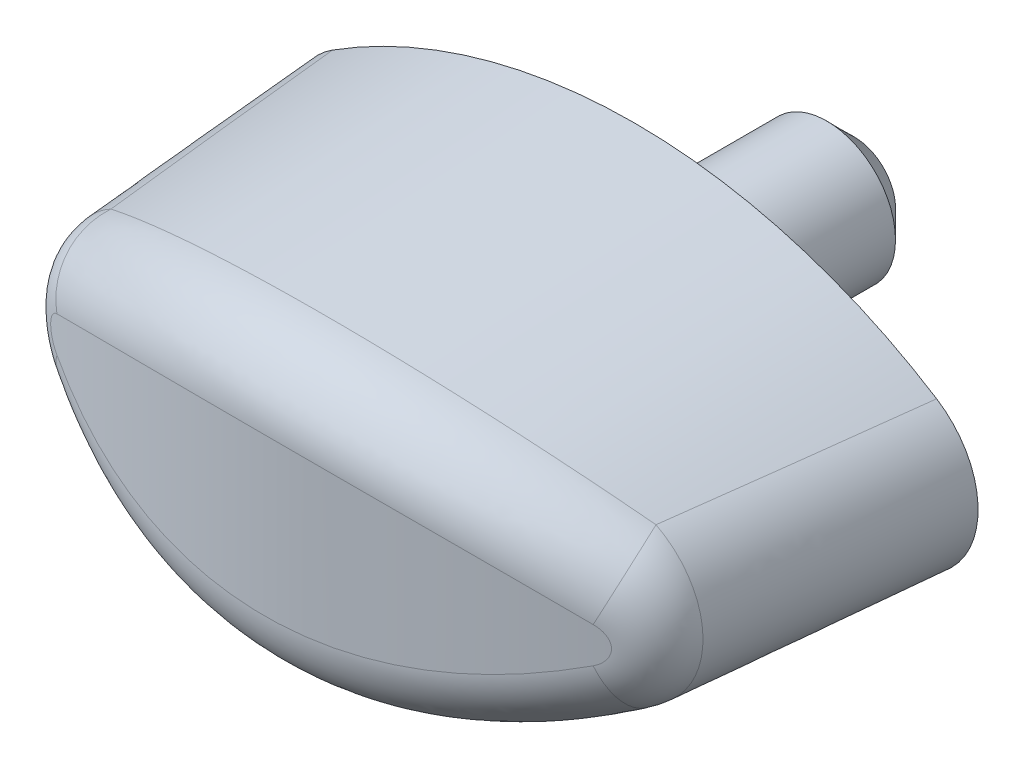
ISO-10303-21;
HEADER;
FILE_DESCRIPTION(('STEP AP214'),'2;1');
FILE_NAME('part.step','',(''),(''),'','','');
FILE_SCHEMA(('AUTOMOTIVE_DESIGN { 1 0 10303 214 1 1 1 1 }'));
ENDSEC;
DATA;
#1=APPLICATION_CONTEXT('core data for automotive mechanical design processes');
#2=APPLICATION_PROTOCOL_DEFINITION('international standard','automotive_design',2000,#1);
#3=PRODUCT_CONTEXT('',#1,'mechanical');
#4=PRODUCT('Part','Part','',(#3));
#5=PRODUCT_RELATED_PRODUCT_CATEGORY('part','',(#4));
#6=PRODUCT_DEFINITION_FORMATION('','',#4);
#7=PRODUCT_DEFINITION_CONTEXT('part definition',#1,'design');
#8=PRODUCT_DEFINITION('design','',#6,#7);
#9=PRODUCT_DEFINITION_SHAPE('','',#8);
#10=(LENGTH_UNIT() NAMED_UNIT(*) SI_UNIT(.MILLI.,.METRE.));
#11=(NAMED_UNIT(*) PLANE_ANGLE_UNIT() SI_UNIT($,.RADIAN.));
#12=(NAMED_UNIT(*) SI_UNIT($,.STERADIAN.) SOLID_ANGLE_UNIT());
#13=UNCERTAINTY_MEASURE_WITH_UNIT(LENGTH_MEASURE(1.E-05),#10,'distance_accuracy_value','');
#14=(GEOMETRIC_REPRESENTATION_CONTEXT(3) GLOBAL_UNCERTAINTY_ASSIGNED_CONTEXT((#13)) GLOBAL_UNIT_ASSIGNED_CONTEXT((#10,
#11,#12)) REPRESENTATION_CONTEXT('',''));
#15=CARTESIAN_POINT('',(0.,0.,0.));
#16=DIRECTION('',(0.,0.,1.));
#17=DIRECTION('',(1.,0.,0.));
#18=AXIS2_PLACEMENT_3D('',#15,#16,#17);
#19=CARTESIAN_POINT('',(0.,11.6598837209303,0.4));
#20=DIRECTION('',(0.,0.,-1.));
#21=DIRECTION('',(1.,0.,0.));
#22=AXIS2_PLACEMENT_3D('',#19,#20,#21);
#23=CONICAL_SURFACE('',#22,16.4098837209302,0.05235987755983);
#24=CARTESIAN_POINT('',(4.70584696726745,-2.46329452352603,29.4670744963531));
#25=CARTESIAN_POINT('',(6.4500654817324,-1.86614656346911,29.7562441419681));
#26=CARTESIAN_POINT('',(6.4500654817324,0.,29.7562441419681));
#27=CARTESIAN_POINT('',(6.4500654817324,1.8661465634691,29.7562441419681));
#28=CARTESIAN_POINT('',(4.70584696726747,2.46329452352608,29.4670744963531));
#29=CARTESIAN_POINT('',(4.81099114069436,-2.45769434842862,28.9339308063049));
#30=CARTESIAN_POINT('',(6.53960510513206,-1.8529266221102,29.2159231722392));
#31=CARTESIAN_POINT('',(6.53980978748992,0.,29.2146516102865));
#32=CARTESIAN_POINT('',(6.53960510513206,1.85292662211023,29.2159231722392));
#33=CARTESIAN_POINT('',(4.81099114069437,2.45769434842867,28.9339308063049));
#34=CARTESIAN_POINT('',(4.91292012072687,-2.45212800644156,28.4003699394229));
#35=CARTESIAN_POINT('',(6.62664245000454,-1.8402282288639,28.6746177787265));
#36=CARTESIAN_POINT('',(6.62682706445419,0.,28.6734280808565));
#37=CARTESIAN_POINT('',(6.62664245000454,1.84022822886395,28.6746177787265));
#38=CARTESIAN_POINT('',(4.91292012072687,2.45212800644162,28.4003699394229));
#39=CARTESIAN_POINT('',(5.11123585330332,-2.44106333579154,27.3325683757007));
#40=CARTESIAN_POINT('',(6.79601117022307,-1.81579592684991,27.5927554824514));
#41=CARTESIAN_POINT('',(6.79620098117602,0.,27.5915534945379));
#42=CARTESIAN_POINT('',(6.79601117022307,1.81579592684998,27.5927554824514));
#43=CARTESIAN_POINT('',(5.11123585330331,2.4410633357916,27.3325683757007));
#44=CARTESIAN_POINT('',(5.20762271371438,-2.43556500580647,26.7983276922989));
#45=CARTESIAN_POINT('',(6.87839257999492,-1.80405353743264,27.0520085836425));
#46=CARTESIAN_POINT('',(6.878557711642,0.,27.0509024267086));
#47=CARTESIAN_POINT('',(6.87839257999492,1.8040535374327,27.0520085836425));
#48=CARTESIAN_POINT('',(5.20762271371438,2.43556500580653,26.7983276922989));
#49=CARTESIAN_POINT('',(5.39573997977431,-2.42463686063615,25.7293366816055));
#50=CARTESIAN_POINT('',(7.03923930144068,-1.78138091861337,25.9711192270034));
#51=CARTESIAN_POINT('',(7.03940190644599,0.,25.9700229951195));
#52=CARTESIAN_POINT('',(7.03923930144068,1.78138091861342,25.9711192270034));
#53=CARTESIAN_POINT('',(5.39573997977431,2.42463686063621,25.7293366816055));
#54=CARTESIAN_POINT('',(5.48747070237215,-2.41920704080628,25.194586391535));
#55=CARTESIAN_POINT('',(7.11774407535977,-1.77044405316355,25.4308176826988));
#56=CARTESIAN_POINT('',(7.1178896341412,0.,25.429794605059));
#57=CARTESIAN_POINT('',(7.11774407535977,1.7704440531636,25.4308176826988));
#58=CARTESIAN_POINT('',(5.48747070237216,2.41920704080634,25.194586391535));
#59=CARTESIAN_POINT('',(5.66690755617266,-2.40841518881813,24.1246310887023));
#60=CARTESIAN_POINT('',(7.27140274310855,-1.7492712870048,24.3506398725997));
#61=CARTESIAN_POINT('',(7.27154760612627,0.,24.3496213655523));
#62=CARTESIAN_POINT('',(7.27140274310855,1.74927128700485,24.3506398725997));
#63=CARTESIAN_POINT('',(5.66690755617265,2.40841518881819,24.1246310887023));
#64=CARTESIAN_POINT('',(5.75461366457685,-2.40305315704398,23.5894260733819));
#65=CARTESIAN_POINT('',(7.34658855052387,-1.73903008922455,23.810626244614));
#66=CARTESIAN_POINT('',(7.34671783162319,0.,23.8096765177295));
#67=CARTESIAN_POINT('',(7.34658855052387,1.73903008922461,23.810626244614));
#68=CARTESIAN_POINT('',(5.75461366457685,2.40305315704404,23.5894260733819));
#69=CARTESIAN_POINT('',(6.01246209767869,-2.38706988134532,21.983434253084));
#70=CARTESIAN_POINT('',(7.56739758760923,-1.70927551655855,22.1941390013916));
#71=CARTESIAN_POINT('',(7.56791718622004,0.,22.1903417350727));
#72=CARTESIAN_POINT('',(7.56739758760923,1.70927551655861,22.1941390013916));
#73=CARTESIAN_POINT('',(6.01246209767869,2.38706988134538,21.983434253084));
#74=CARTESIAN_POINT('',(6.17736719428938,-2.37654953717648,20.9120827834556));
#75=CARTESIAN_POINT('',(7.70923415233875,-1.69059687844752,21.1146231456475));
#76=CARTESIAN_POINT('',(7.70966291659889,0.,21.111261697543));
#77=CARTESIAN_POINT('',(7.70923415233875,1.69059687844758,21.1146231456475));
#78=CARTESIAN_POINT('',(6.17736719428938,2.37654953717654,20.9120827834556));
#79=CARTESIAN_POINT('',(6.49623191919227,-2.35577177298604,18.7682719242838));
#80=CARTESIAN_POINT('',(7.98388483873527,-1.65515669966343,18.9568863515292));
#81=CARTESIAN_POINT('',(7.98430780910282,0.,18.9535563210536));
#82=CARTESIAN_POINT('',(7.98388483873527,1.65515669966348,18.9568863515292));
#83=CARTESIAN_POINT('',(6.49623191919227,2.3557717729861,18.7682719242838));
#84=CARTESIAN_POINT('',(6.65019132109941,-2.34551435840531,17.6958125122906));
#85=CARTESIAN_POINT('',(8.11684799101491,-1.63837130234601,17.8779221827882));
#86=CARTESIAN_POINT('',(8.11720678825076,0.,17.8749309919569));
#87=CARTESIAN_POINT('',(8.11684799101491,1.63837130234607,17.8779221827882));
#88=CARTESIAN_POINT('',(6.65019132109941,2.34551435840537,17.6958125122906));
#89=CARTESIAN_POINT('',(6.94917110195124,-2.32525824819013,15.5503775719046));
#90=CARTESIAN_POINT('',(8.3754837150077,-1.60635722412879,15.7212543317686));
#91=CARTESIAN_POINT('',(8.37584003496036,0.,15.7182824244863));
#92=CARTESIAN_POINT('',(8.3754837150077,1.60635722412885,15.7212543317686));
#93=CARTESIAN_POINT('',(6.94917110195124,2.32525824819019,15.5503775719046));
#94=CARTESIAN_POINT('',(7.09419410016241,-2.31525947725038,14.4774022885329));
#95=CARTESIAN_POINT('',(8.50126948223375,-1.59111074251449,14.6429515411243));
#96=CARTESIAN_POINT('',(8.50157640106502,0.,14.6402591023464));
#97=CARTESIAN_POINT('',(8.50126948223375,1.59111074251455,14.6429515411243));
#98=CARTESIAN_POINT('',(7.09419410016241,2.31525947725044,14.4774022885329));
#99=CARTESIAN_POINT('',(7.37685619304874,-2.29550976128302,12.3308063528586));
#100=CARTESIAN_POINT('',(8.74687145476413,-1.56190212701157,12.4870684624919));
#101=CARTESIAN_POINT('',(8.7471761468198,0.,12.4843922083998));
#102=CARTESIAN_POINT('',(8.74687145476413,1.56190212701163,12.4870684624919));
#103=CARTESIAN_POINT('',(7.37685619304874,2.29550976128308,12.3308063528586));
#104=CARTESIAN_POINT('',(7.51449534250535,-2.28575881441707,11.2571857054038));
#105=CARTESIAN_POINT('',(8.86677346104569,-1.54792693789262,11.4089915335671));
#106=CARTESIAN_POINT('',(8.86703957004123,0.,11.4065486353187));
#107=CARTESIAN_POINT('',(8.86677346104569,1.54792693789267,11.4089915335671));
#108=CARTESIAN_POINT('',(7.51449534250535,2.28575881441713,11.2571857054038));
#109=CARTESIAN_POINT('',(7.78353291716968,-2.26649617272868,9.10936146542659));
#110=CARTESIAN_POINT('',(9.10156824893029,-1.52105947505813,9.25334077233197));
#111=CARTESIAN_POINT('',(9.10183315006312,0.,9.25090846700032));
#112=CARTESIAN_POINT('',(9.10156824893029,1.5210594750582,9.25334077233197));
#113=CARTESIAN_POINT('',(7.78353291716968,2.26649617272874,9.10936146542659));
#114=CARTESIAN_POINT('',(7.91493102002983,-2.25698449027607,8.03515784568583));
#115=CARTESIAN_POINT('',(9.21652871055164,-1.50815718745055,8.17534808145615));
#116=CARTESIAN_POINT('',(9.21676305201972,0.,8.17311187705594));
#117=CARTESIAN_POINT('',(9.21652871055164,1.50815718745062,8.17534808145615));
#118=CARTESIAN_POINT('',(7.91493102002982,2.25698449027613,8.03515784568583));
#119=CARTESIAN_POINT('',(8.17235300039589,-2.23819295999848,5.88631382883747));
#120=CARTESIAN_POINT('',(9.44216335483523,-1.48328190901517,6.01979713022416));
#121=CARTESIAN_POINT('',(9.44239554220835,0.,6.01757645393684));
#122=CARTESIAN_POINT('',(9.44216335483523,1.48328190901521,6.01979713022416));
#123=CARTESIAN_POINT('',(8.1723530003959,2.23819295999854,5.88631382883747));
#124=CARTESIAN_POINT('',(8.29837686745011,-2.22891311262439,4.81167343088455));
#125=CARTESIAN_POINT('',(9.55289252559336,-1.47130097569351,4.94188033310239));
#126=CARTESIAN_POINT('',(9.55309812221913,0.,4.93983762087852));
#127=CARTESIAN_POINT('',(9.55289252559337,1.47130097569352,4.94188033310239));
#128=CARTESIAN_POINT('',(8.29837686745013,2.22891311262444,4.81167343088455));
#129=CARTESIAN_POINT('',(8.66939307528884,-2.20141530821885,1.58788070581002));
#130=CARTESIAN_POINT('',(9.87884646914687,-1.43663651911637,1.7155180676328));
#131=CARTESIAN_POINT('',(9.87967438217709,0.,1.70733854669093));
#132=CARTESIAN_POINT('',(9.87884646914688,1.43663651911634,1.7155180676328));
#133=CARTESIAN_POINT('',(8.66939307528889,2.20141530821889,1.58788070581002));
#134=CARTESIAN_POINT('',(8.90741335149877,-2.18353306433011,-0.561816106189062));
#135=CARTESIAN_POINT('',(10.0894167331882,-1.41505378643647,-0.440319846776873));
#136=CARTESIAN_POINT('',(10.0900893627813,0.,-0.447379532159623));
#137=CARTESIAN_POINT('',(10.0894167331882,1.41505378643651,-0.440319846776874));
#138=CARTESIAN_POINT('',(8.90741335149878,2.18353306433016,-0.561816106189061));
#139=CARTESIAN_POINT('',(9.36897770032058,-2.14860484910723,-4.86221523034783));
#140=CARTESIAN_POINT('',(10.4990051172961,-1.37439669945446,-4.74979952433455));
#141=CARTESIAN_POINT('',(10.4996664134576,0.,-4.75677472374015));
#142=CARTESIAN_POINT('',(10.4990051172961,1.37439669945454,-4.74979952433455));
#143=CARTESIAN_POINT('',(9.36897770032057,2.1486048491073,-4.86221523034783));
#144=CARTESIAN_POINT('',(9.5925220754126,-2.131558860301,-7.01291752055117));
#145=CARTESIAN_POINT('',(10.6982780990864,-1.35528820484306,-6.90534782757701));
#146=CARTESIAN_POINT('',(10.698828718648,0.,-6.91145183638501));
#147=CARTESIAN_POINT('',(10.6982780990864,1.35528820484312,-6.90534782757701));
#148=CARTESIAN_POINT('',(9.5925220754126,2.13155886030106,-7.01291752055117));
#149=CARTESIAN_POINT('',(10.0280362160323,-2.09824251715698,-11.3157174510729));
#150=CARTESIAN_POINT('',(11.0876591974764,-1.31907365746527,-11.2153558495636));
#151=CARTESIAN_POINT('',(11.0882115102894,0.,-11.2214600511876));
#152=CARTESIAN_POINT('',(11.0876591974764,1.31907365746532,-11.2153558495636));
#153=CARTESIAN_POINT('',(10.0280362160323,2.09824251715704,-11.3157174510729));
#154=CARTESIAN_POINT('',(10.2400027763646,-2.08197237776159,-13.467815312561));
#155=CARTESIAN_POINT('',(11.2779534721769,-1.30194412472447,-13.3713380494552));
#156=CARTESIAN_POINT('',(11.2784295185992,0.,-13.3767911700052));
#157=CARTESIAN_POINT('',(11.2779534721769,1.30194412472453,-13.3713380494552));
#158=CARTESIAN_POINT('',(10.2400027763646,2.08197237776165,-13.467815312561));
#159=CARTESIAN_POINT('',(10.6542513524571,-2.05016216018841,-17.7726827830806));
#160=CARTESIAN_POINT('',(11.6509526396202,-1.26934468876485,-17.6822814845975));
#161=CARTESIAN_POINT('',(11.651405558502,0.,-17.6875648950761));
#162=CARTESIAN_POINT('',(11.6509526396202,1.26934468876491,-17.6822814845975));
#163=CARTESIAN_POINT('',(10.6542513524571,2.05016216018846,-17.7726827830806));
#164=CARTESIAN_POINT('',(10.8565332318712,-2.03462209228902,-19.9254524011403));
#165=CARTESIAN_POINT('',(11.8338028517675,-1.25385715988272,-19.8384937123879));
#166=CARTESIAN_POINT('',(11.8341634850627,0.,-19.8430075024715));
#167=CARTESIAN_POINT('',(11.8338028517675,1.25385715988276,-19.8384937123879));
#168=CARTESIAN_POINT('',(10.8565332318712,2.03462209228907,-19.9254524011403));
#169=CARTESIAN_POINT('',(11.0549480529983,-2.01942199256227,-22.0784618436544));
#170=CARTESIAN_POINT('',(12.0139589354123,-1.23900819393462,-21.9985010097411));
#171=CARTESIAN_POINT('',(12.0139589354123,0.,-21.9985010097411));
#172=CARTESIAN_POINT('',(12.0139589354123,1.23900819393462,-21.9985010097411));
#173=CARTESIAN_POINT('',(11.0549480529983,2.0194219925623,-22.0784618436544));
#174=(BOUNDED_SURFACE() B_SPLINE_SURFACE(3,2,((#24,#25,#26,#27,#28),(#29,#30,#31,#32,#33),(#34,
#35,#36,#37,#38),(#39,#40,#41,#42,#43),(#44,#45,#46,#47,#48),(#49,#50,#51,#52,#53),(#54,#55,#56,
#57,#58),(#59,#60,#61,#62,#63),(#64,#65,#66,#67,#68),(#69,#70,#71,#72,#73),(#74,#75,#76,#77,
#78),(#79,#80,#81,#82,#83),(#84,#85,#86,#87,#88),(#89,#90,#91,#92,#93),(#94,#95,#96,#97,#98),
(#99,#100,#101,#102,#103),(#104,#105,#106,#107,#108),(#109,#110,#111,#112,#113),(#114,#115,#116,
#117,#118),(#119,#120,#121,#122,#123),(#124,#125,#126,#127,#128),(#129,#130,#131,#132,#133),
(#134,#135,#136,#137,#138),(#139,#140,#141,#142,#143),(#144,#145,#146,#147,#148),(#149,#150,
#151,#152,#153),(#154,#155,#156,#157,#158),(#159,#160,#161,#162,#163),(#164,#165,#166,#167,
#168),(#169,#170,#171,#172,#173)),.UNSPECIFIED.,.F.,.F.,.F.) B_SPLINE_SURFACE_WITH_KNOTS((4,2,2,
2,2,2,2,2,2,2,2,2,2,2,4),(3,2,3),(0.,1.62122580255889,3.24242004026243,4.86350377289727,
6.48459668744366,9.72621281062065,12.9678959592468,16.2086244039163,19.449328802,
22.6902003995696,25.9310782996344,32.410803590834,38.8903934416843,45.3717681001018,
51.8532339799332),(0.,0.5,1.),
.UNSPECIFIED.) GEOMETRIC_REPRESENTATION_ITEM() RATIONAL_B_SPLINE_SURFACE(((1.,0.812400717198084,
1.,0.812400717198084,1.),(1.,0.814361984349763,1.,0.814361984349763,1.),(1.,0.816241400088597,
1.,0.816241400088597,1.),(1.,0.81985834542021,1.,0.81985834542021,1.),(1.,0.821595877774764,1.,
0.821595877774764,1.),(1.,0.824950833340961,1.,0.824950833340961,1.),(1.,0.826568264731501,1.,
0.826568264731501,1.),(1.,0.829698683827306,1.,0.829698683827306,1.),(1.,0.831211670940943,1.,
0.831211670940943,1.),(1.,0.835613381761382,1.,0.835613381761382,1.),(1.,0.83836543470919,1.,
0.83836543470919,1.),(1.,0.843581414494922,1.,0.843581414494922,1.),(1.,0.846045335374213,1.,
0.846045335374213,1.),(1.,0.850736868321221,1.,0.850736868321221,1.),(1.,0.852964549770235,1.,
0.852964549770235,1.),(1.,0.857223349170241,1.,0.857223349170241,1.),(1.,0.859254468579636,1.,
0.859254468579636,1.),(1.,0.863149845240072,1.,0.863149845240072,1.),(1.,0.865014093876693,1.,
0.865014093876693,1.),(1.,0.868598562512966,1.,0.868598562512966,1.),(1.,0.870318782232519,1.,
0.870318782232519,1.),(1.,0.875290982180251,1.,0.875290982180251,1.),(1.,0.878355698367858,1.,
0.878355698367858,1.),(1.,0.884095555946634,1.,0.884095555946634,1.),(1.,0.886770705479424,1.,
0.886770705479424,1.),(1.,0.891808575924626,1.,0.891808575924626,1.),(1.,0.894171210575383,1.,
0.894171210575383,1.),(1.,0.898636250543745,1.,0.898636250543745,1.),(1.,0.900738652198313,1.,
0.900738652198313,1.),(1.,0.902737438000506,1.,0.902737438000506,1.))) REPRESENTATION_ITEM('') SURFACE());
#175=CARTESIAN_POINT('',(11.0549480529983,-2.01942199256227,-22.0784618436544));
#176=CARTESIAN_POINT('',(10.8565332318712,-2.03462209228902,-19.9254524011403));
#177=CARTESIAN_POINT('',(10.6542513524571,-2.05016216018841,-17.7726827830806));
#178=CARTESIAN_POINT('',(10.2400027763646,-2.08197237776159,-13.467815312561));
#179=CARTESIAN_POINT('',(10.0280362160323,-2.09824251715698,-11.3157174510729));
#180=CARTESIAN_POINT('',(9.5925220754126,-2.131558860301,-7.01291752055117));
#181=CARTESIAN_POINT('',(9.36897770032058,-2.14860484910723,-4.86221523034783));
#182=CARTESIAN_POINT('',(8.90741335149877,-2.18353306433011,-0.56181610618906));
#183=CARTESIAN_POINT('',(8.66939307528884,-2.20141530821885,1.58788070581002));
#184=CARTESIAN_POINT('',(8.29837686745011,-2.22891311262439,4.81167343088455));
#185=CARTESIAN_POINT('',(8.17235300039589,-2.23819295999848,5.88631382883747));
#186=CARTESIAN_POINT('',(7.91493102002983,-2.25698449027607,8.03515784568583));
#187=CARTESIAN_POINT('',(7.78353291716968,-2.26649617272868,9.10936146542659));
#188=CARTESIAN_POINT('',(7.51449534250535,-2.28575881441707,11.2571857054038));
#189=CARTESIAN_POINT('',(7.37685619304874,-2.29550976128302,12.3308063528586));
#190=CARTESIAN_POINT('',(7.09419410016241,-2.31525947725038,14.4774022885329));
#191=CARTESIAN_POINT('',(6.94917110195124,-2.32525824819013,15.5503775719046));
#192=CARTESIAN_POINT('',(6.65019132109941,-2.34551435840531,17.6958125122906));
#193=CARTESIAN_POINT('',(6.49623191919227,-2.35577177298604,18.7682719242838));
#194=CARTESIAN_POINT('',(6.17736719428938,-2.37654953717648,20.9120827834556));
#195=CARTESIAN_POINT('',(6.01246209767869,-2.38706988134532,21.983434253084));
#196=CARTESIAN_POINT('',(5.75461366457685,-2.40305315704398,23.5894260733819));
#197=CARTESIAN_POINT('',(5.66690755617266,-2.40841518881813,24.1246310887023));
#198=CARTESIAN_POINT('',(5.48747070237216,-2.41920704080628,25.194586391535));
#199=CARTESIAN_POINT('',(5.39573997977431,-2.42463686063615,25.7293366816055));
#200=CARTESIAN_POINT('',(5.20762271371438,-2.43556500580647,26.7983276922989));
#201=CARTESIAN_POINT('',(5.11123585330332,-2.44106333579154,27.3325683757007));
#202=CARTESIAN_POINT('',(4.91292012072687,-2.45212800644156,28.4003699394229));
#203=CARTESIAN_POINT('',(4.81099114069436,-2.45769434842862,28.9339308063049));
#204=CARTESIAN_POINT('',(4.70584696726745,-2.46329452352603,29.4670744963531));
#205=B_SPLINE_CURVE_WITH_KNOTS('',3,(#175,#176,#177,#178,#179,#180,#181,#182,#183,#184,#185,
#186,#187,#188,#189,#190,#191,#192,#193,#194,#195,#196,#197,#198,#199,#200,#201,#202,#203,#204),
.UNSPECIFIED.,.F.,.F.,(4,2,2,2,2,2,2,2,2,2,2,2,2,2,4),(0.,6.48146587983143,12.9628405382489,
19.4424303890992,25.9221556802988,29.1630335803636,32.4039051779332,35.644609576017,
38.8853380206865,42.1270211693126,45.3686372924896,46.989730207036,48.6108139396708,
50.2320081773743,51.8532339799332),.UNSPECIFIED.);
#206=CARTESIAN_POINT('',(8.7988338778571,-2.1916434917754,0.4));
#207=VERTEX_POINT('',#206);
#208=CARTESIAN_POINT('',(7.9512389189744,-2.25431991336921,7.728160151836));
#209=VERTEX_POINT('',#208);
#210=EDGE_CURVE('E87',#207,#209,#205,.T.);
#211=ORIENTED_EDGE('',*,*,#210,.T.);
#212=CARTESIAN_POINT('',(12.2736553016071,2.63373473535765,6.42417025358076));
#213=CARTESIAN_POINT('',(12.77636524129,1.81758842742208,5.96291903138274));
#214=CARTESIAN_POINT('',(12.461046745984,1.36138005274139,5.0551674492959));
#215=CARTESIAN_POINT('',(11.9706353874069,2.32801953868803,6.70223633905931));
#216=CARTESIAN_POINT('',(12.488563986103,1.46779976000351,6.24823784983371));
#217=CARTESIAN_POINT('',(12.1548919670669,1.01140775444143,5.30253483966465));
#218=CARTESIAN_POINT('',(11.6512904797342,2.03180971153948,6.97619825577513));
#219=CARTESIAN_POINT('',(12.1856194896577,1.12905521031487,6.52923063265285));
#220=CARTESIAN_POINT('',(11.8320426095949,0.672173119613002,5.54625116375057));
#221=CARTESIAN_POINT('',(10.9790357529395,1.45993567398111,7.51185168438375));
#222=CARTESIAN_POINT('',(11.5434286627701,0.469016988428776,7.08373716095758));
#223=CARTESIAN_POINT('',(11.1519903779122,0.0169905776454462,6.02276806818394));
#224=CARTESIAN_POINT('',(10.6260581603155,1.18431503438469,7.77351676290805));
#225=CARTESIAN_POINT('',(11.2032688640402,0.147847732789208,7.35728582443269));
#226=CARTESIAN_POINT('',(10.7947181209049,-0.298907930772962,6.25554513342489));
#227=CARTESIAN_POINT('',(9.88384439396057,0.654270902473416,8.28140086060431));
#228=CARTESIAN_POINT('',(10.4818894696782,-0.476462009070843,7.89399763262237));
#229=CARTESIAN_POINT('',(10.043051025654,-0.906621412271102,6.70735846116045));
#230=CARTESIAN_POINT('',(9.49433510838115,0.400039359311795,8.52747593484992));
#231=CARTESIAN_POINT('',(10.0995869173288,-0.779098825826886,8.15686533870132));
#232=CARTESIAN_POINT('',(9.64837629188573,-1.19821811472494,6.9262666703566));
#233=CARTESIAN_POINT('',(8.68214605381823,-0.0813138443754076,8.99666377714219));
#234=CARTESIAN_POINT('',(9.29411568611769,-1.35935418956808,8.66446610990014));
#235=CARTESIAN_POINT('',(8.82500204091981,-1.75049232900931,7.34365583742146));
#236=CARTESIAN_POINT('',(8.25949669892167,-0.308459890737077,9.21979717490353));
#237=CARTESIAN_POINT('',(8.87032540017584,-1.63643874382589,8.90879967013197));
#238=CARTESIAN_POINT('',(8.39633371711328,-2.01119765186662,7.54215514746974));
#239=CARTESIAN_POINT('',(7.51250999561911,-0.669080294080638,9.57585506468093));
#240=CARTESIAN_POINT('',(8.1142895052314,-2.08135871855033,9.30318467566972));
#241=CARTESIAN_POINT('',(7.63837958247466,-2.42521175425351,7.85890398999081));
#242=CARTESIAN_POINT('',(7.19626998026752,-0.810334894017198,9.71588520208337));
#243=CARTESIAN_POINT('',(7.7906787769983,-2.25768434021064,9.46013499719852));
#244=CARTESIAN_POINT('',(7.31740432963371,-2.58741623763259,7.98347469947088));
#245=CARTESIAN_POINT('',(6.54875624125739,-1.0761955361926,9.98019448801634));
#246=CARTESIAN_POINT('',(7.1220456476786,-2.59295898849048,9.75945606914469));
#247=CARTESIAN_POINT('',(6.66001964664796,-2.89276100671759,8.21860405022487));
#248=CARTESIAN_POINT('',(6.21748628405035,-1.20080571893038,10.1044775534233));
#249=CARTESIAN_POINT('',(6.77706313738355,-2.75154103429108,9.90151071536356));
#250=CARTESIAN_POINT('',(6.32361408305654,-3.03590603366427,8.32916617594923));
#251=CARTESIAN_POINT('',(5.5419987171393,-1.43154926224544,10.3350946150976));
#252=CARTESIAN_POINT('',(6.06709303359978,-3.04821010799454,10.1678497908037));
#253=CARTESIAN_POINT('',(5.63749685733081,-3.3010106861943,8.53432294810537));
#254=CARTESIAN_POINT('',(5.19781990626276,-1.53773331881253,10.4414778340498));
#255=CARTESIAN_POINT('',(5.70236920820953,-3.18593239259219,10.2918123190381));
#256=CARTESIAN_POINT('',(5.28782503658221,-3.4230284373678,8.62896138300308));
#257=CARTESIAN_POINT('',(4.4974353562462,-1.73049960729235,10.6348557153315));
#258=CARTESIAN_POINT('',(4.95349171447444,-3.43840857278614,10.5193952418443));
#259=CARTESIAN_POINT('',(4.57612718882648,-3.64456593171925,8.80099020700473));
#260=CARTESIAN_POINT('',(4.14123524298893,-1.81709086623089,10.7218593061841));
#261=CARTESIAN_POINT('',(4.56978035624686,-3.55272247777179,10.6226225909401));
#262=CARTESIAN_POINT('',(4.21410693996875,-3.7440960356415,8.87838853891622));
#263=CARTESIAN_POINT('',(3.41587206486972,-1.96994848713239,10.8755006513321));
#264=CARTESIAN_POINT('',(3.78197068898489,-3.75629507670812,10.8065608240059));
#265=CARTESIAN_POINT('',(3.4767818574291,-3.91980987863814,9.0150677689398));
#266=CARTESIAN_POINT('',(3.04662786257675,-2.03604601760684,10.9419692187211));
#267=CARTESIAN_POINT('',(3.37845029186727,-3.84489587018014,10.8866793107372));
#268=CARTESIAN_POINT('',(3.10139367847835,-3.99579968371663,9.07419815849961));
#269=CARTESIAN_POINT('',(2.30057207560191,-2.14576562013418,11.0521826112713));
#270=CARTESIAN_POINT('',(2.55758944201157,-3.99301523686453,11.0205232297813));
#271=CARTESIAN_POINT('',(2.34284328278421,-4.12194657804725,9.1722439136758));
#272=CARTESIAN_POINT('',(1.92376045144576,-2.18938757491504,11.0959273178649));
#273=CARTESIAN_POINT('',(2.14118128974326,-4.05216439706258,11.0739141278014));
#274=CARTESIAN_POINT('',(1.95968102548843,-4.17210353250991,9.21115917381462));
#275=CARTESIAN_POINT('',(1.16547561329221,-2.25331722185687,11.1597168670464));
#276=CARTESIAN_POINT('',(1.29920905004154,-4.13924602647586,11.1522052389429));
#277=CARTESIAN_POINT('',(1.18856908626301,-4.24561030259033,9.26790631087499));
#278=CARTESIAN_POINT('',(0.784000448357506,-2.27361479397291,11.1797514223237));
#279=CARTESIAN_POINT('',(0.874763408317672,-4.16692724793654,11.1768777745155));
#280=CARTESIAN_POINT('',(0.800617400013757,-4.268948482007,9.28572903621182));
#281=CARTESIAN_POINT('',(0.0199004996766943,-2.290447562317,11.1956061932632));
#282=CARTESIAN_POINT('',(0.0226123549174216,-4.18984716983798,11.1965410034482));
#283=CARTESIAN_POINT('',(0.0235328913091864,-4.28829764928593,9.29983342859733));
#284=CARTESIAN_POINT('',(-0.362724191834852,-2.28698461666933,11.1914283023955));
#285=CARTESIAN_POINT('',(-0.403874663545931,-4.18502393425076,11.1914769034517));
#286=CARTESIAN_POINT('',(-0.365599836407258,-4.28431077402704,9.29611678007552));
#287=CARTESIAN_POINT('',(-1.09251137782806,-2.25771933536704,11.1603720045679));
#288=CARTESIAN_POINT('',(-1.21714276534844,-4.14478447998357,11.1534273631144));
#289=CARTESIAN_POINT('',(-1.1077774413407,-4.25064756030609,9.26848911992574));
#290=CARTESIAN_POINT('',(-1.43986323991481,-2.23388655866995,11.1354999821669));
#291=CARTESIAN_POINT('',(-1.60313363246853,-4.11216345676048,11.1229997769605));
#292=CARTESIAN_POINT('',(-1.46101686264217,-4.22323617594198,9.24636298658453));
#293=CARTESIAN_POINT('',(-2.13022718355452,-2.16690650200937,11.0661333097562));
#294=CARTESIAN_POINT('',(-2.36837418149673,-4.0207896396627,11.0383152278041));
#295=CARTESIAN_POINT('',(-2.16303670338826,-4.1462068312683,9.18465444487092));
#296=CARTESIAN_POINT('',(-2.47323915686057,-2.12375874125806,11.0216381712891));
#297=CARTESIAN_POINT('',(-2.74679844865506,-3.96224210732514,10.9842469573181));
#298=CARTESIAN_POINT('',(-2.51181701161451,-4.09658831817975,9.14507160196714));
#299=CARTESIAN_POINT('',(-3.15239788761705,-2.0188855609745,10.9138714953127));
#300=CARTESIAN_POINT('',(-3.49281583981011,-3.82063327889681,10.8538800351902));
#301=CARTESIAN_POINT('',(-3.20232696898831,-3.97600015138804,9.04920244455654));
#302=CARTESIAN_POINT('',(-3.48854920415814,-1.95717293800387,10.850612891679));
#303=CARTESIAN_POINT('',(-3.85973014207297,-3.73787970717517,10.7778624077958));
#304=CARTESIAN_POINT('',(-3.54406130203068,-3.9050452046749,8.99292763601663));
#305=CARTESIAN_POINT('',(-4.15218576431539,-1.81612013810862,10.7064235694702));
#306=CARTESIAN_POINT('',(-4.57986365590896,-3.54993554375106,10.6056601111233));
#307=CARTESIAN_POINT('',(-4.21862845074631,-3.74288760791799,8.86465691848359));
#308=CARTESIAN_POINT('',(-4.47967146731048,-1.73678089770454,10.6254937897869));
#309=CARTESIAN_POINT('',(-4.93256877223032,-3.44508419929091,10.5097831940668));
#310=CARTESIAN_POINT('',(-4.55146173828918,-3.65168603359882,8.79266184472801));
#311=CARTESIAN_POINT('',(-5.33834884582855,-1.50336492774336,10.3880340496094));
#312=CARTESIAN_POINT('',(-5.84824463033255,-3.1398465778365,10.2313938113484));
#313=CARTESIAN_POINT('',(-5.42401275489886,-3.38340927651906,8.58141783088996));
#314=CARTESIAN_POINT('',(-5.86060548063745,-1.33461753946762,10.2169608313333));
#315=CARTESIAN_POINT('',(-6.39901993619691,-2.92194339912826,10.0333261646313));
#316=CARTESIAN_POINT('',(-5.95455146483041,-3.18949529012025,8.42923121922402));
#317=CARTESIAN_POINT('',(-6.87165225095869,-0.956525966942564,9.8357352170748));
#318=CARTESIAN_POINT('',(-7.45224777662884,-2.44011778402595,9.59773501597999));
#319=CARTESIAN_POINT('',(-6.98125997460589,-2.75514849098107,8.09009318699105));
#320=CARTESIAN_POINT('',(-7.36039727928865,-0.747128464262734,9.62553151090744));
#321=CARTESIAN_POINT('',(-7.95422429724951,-2.17755748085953,9.36140686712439));
#322=CARTESIAN_POINT('',(-7.47738346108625,-2.51465458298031,7.9030961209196));
#323=CARTESIAN_POINT('',(-8.2687230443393,-0.308660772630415,9.18834750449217));
#324=CARTESIAN_POINT('',(-8.87615322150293,-1.63473557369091,8.8761543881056));
#325=CARTESIAN_POINT('',(-8.39902024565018,-2.01124908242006,7.51417754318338));
#326=CARTESIAN_POINT('',(-8.69074709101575,-0.0818982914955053,8.96348160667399));
#327=CARTESIAN_POINT('',(-9.29909987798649,-1.35812204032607,8.63022658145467));
#328=CARTESIAN_POINT('',(-8.82704107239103,-1.7509758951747,7.31413700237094));
#329=CARTESIAN_POINT('',(-9.50184790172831,0.398618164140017,8.49075141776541));
#330=CARTESIAN_POINT('',(-10.1030808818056,-0.778903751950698,8.11939339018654));
#331=CARTESIAN_POINT('',(-9.64928434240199,-1.19964640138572,6.89359656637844));
#332=CARTESIAN_POINT('',(-9.89088711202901,0.652402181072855,8.24286156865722));
#333=CARTESIAN_POINT('',(-10.4847325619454,-0.476820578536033,7.85488015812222));
#334=CARTESIAN_POINT('',(-10.043468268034,-0.90855583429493,6.67307393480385));
#335=CARTESIAN_POINT('',(-10.6341657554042,1.18282304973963,7.72994588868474));
#336=CARTESIAN_POINT('',(-11.2067754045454,0.14785496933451,7.31344325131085));
#337=CARTESIAN_POINT('',(-10.7961834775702,-0.300397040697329,6.21678451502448));
#338=CARTESIAN_POINT('',(-10.9884978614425,1.45939519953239,7.46496900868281));
#339=CARTESIAN_POINT('',(-11.5480825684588,0.470092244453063,7.03671780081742));
#340=CARTESIAN_POINT('',(-11.15480973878,0.0165976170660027,5.98106127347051));
#341=CARTESIAN_POINT('',(-11.6630745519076,2.03316508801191,6.92254511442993));
#342=CARTESIAN_POINT('',(-12.192183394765,1.13220519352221,6.47577654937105));
#343=CARTESIAN_POINT('',(-11.8371735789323,0.673960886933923,5.49852136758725));
#344=CARTESIAN_POINT('',(-11.9833943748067,2.3303147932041,6.6451276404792));
#345=CARTESIAN_POINT('',(-12.4959110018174,1.47195598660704,6.19152525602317));
#346=CARTESIAN_POINT('',(-12.1609881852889,1.01427504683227,5.25173098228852));
#347=CARTESIAN_POINT('',(-12.2872602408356,2.6369720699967,6.36351191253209));
#348=CARTESIAN_POINT('',(-12.784384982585,1.82275378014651,5.90284195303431));
#349=CARTESIAN_POINT('',(-12.4679757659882,1.36532754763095,5.00120583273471));
#350=(BOUNDED_SURFACE() B_SPLINE_SURFACE(3,2,((#212,#213,#214),(#215,#216,#217),(#218,#219,
#220),(#221,#222,#223),(#224,#225,#226),(#227,#228,#229),(#230,#231,#232),(#233,#234,#235),
(#236,#237,#238),(#239,#240,#241),(#242,#243,#244),(#245,#246,#247),(#248,#249,#250),(#251,#252,
#253),(#254,#255,#256),(#257,#258,#259),(#260,#261,#262),(#263,#264,#265),(#266,#267,#268),
(#269,#270,#271),(#272,#273,#274),(#275,#276,#277),(#278,#279,#280),(#281,#282,#283),(#284,#285,
#286),(#287,#288,#289),(#290,#291,#292),(#293,#294,#295),(#296,#297,#298),(#299,#300,#301),
(#302,#303,#304),(#305,#306,#307),(#308,#309,#310),(#311,#312,#313),(#314,#315,#316),(#317,#318,
#319),(#320,#321,#322),(#323,#324,#325),(#326,#327,#328),(#329,#330,#331),(#332,#333,#334),
(#335,#336,#337),(#338,#339,#340),(#341,#342,#343),(#344,#345,#346),(#347,#348,#349)),
.UNSPECIFIED.,.F.,.F.,.F.) B_SPLINE_SURFACE_WITH_KNOTS((4,2,2,2,2,2,2,2,2,2,2,2,2,2,2,2,2,2,2,2,
2,2,4),(3,3),(0.,1.43034531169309,2.86363646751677,4.30865830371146,5.75236916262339,
6.76716067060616,7.78169926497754,8.79340069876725,9.8046350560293,10.8239914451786,
11.8433531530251,12.8631569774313,13.8828810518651,14.8138970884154,15.7449363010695,
16.6753352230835,17.6056847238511,19.1530154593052,20.7023896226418,22.1463512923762,
23.5919354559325,25.0335479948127,26.4719020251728),(0.,1.),
.UNSPECIFIED.) GEOMETRIC_REPRESENTATION_ITEM() RATIONAL_B_SPLINE_SURFACE(((1.,0.882886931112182,
1.),(1.,0.87597346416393,1.),(1.,0.868817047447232,1.),(1.,0.854183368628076,1.),(1.,
0.846705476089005,1.),(1.,0.831562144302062,1.),(1.,0.823895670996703,1.),(1.,0.808697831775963,
1.),(1.,0.801166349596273,1.),(1.,0.788726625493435,1.),(1.,0.783703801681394,1.),(1.,
0.774011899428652,1.),(1.,0.769342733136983,1.),(1.,0.760510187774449,1.),(1.,0.756345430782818,
1.),(1.,0.748652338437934,1.),(1.,0.745123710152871,1.),(1.,0.738813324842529,1.),(1.,
0.736037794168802,1.),(1.,0.731393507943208,1.),(1.,0.729524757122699,1.),(1.,0.726782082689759,
1.),(1.,0.725908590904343,1.),(1.,0.725201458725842,1.),(1.,0.72536773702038,1.),(1.,
0.726671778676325,1.),(1.,0.727723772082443,1.),(1.,0.730643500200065,1.),(1.,0.732511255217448,
1.),(1.,0.73698826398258,1.),(1.,0.739597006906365,1.),(1.,0.745460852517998,1.),(1.,
0.748715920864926,1.),(1.,0.758106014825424,1.),(1.,0.764719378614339,1.),(1.,0.778932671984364,
1.),(1.,0.786533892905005,1.),(1.,0.801708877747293,1.),(1.,0.809249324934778,1.),(1.,
0.824462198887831,1.),(1.,0.832134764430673,1.),(1.,0.847326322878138,1.),(1.,0.854845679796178,
1.),(1.,0.869553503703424,1.),(1.,0.876742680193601,1.),(1.,0.883684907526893,1.))) REPRESENTATION_ITEM('') SURFACE());
#351=CARTESIAN_POINT('',(12.461046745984,1.36138005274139,5.0551674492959));
#352=CARTESIAN_POINT('',(12.1548919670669,1.01140775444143,5.30253483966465));
#353=CARTESIAN_POINT('',(11.8320426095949,0.672173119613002,5.54625116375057));
#354=CARTESIAN_POINT('',(11.1519903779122,0.0169905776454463,6.02276806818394));
#355=CARTESIAN_POINT('',(10.7947181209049,-0.298907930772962,6.25554513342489));
#356=CARTESIAN_POINT('',(10.043051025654,-0.906621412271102,6.70735846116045));
#357=CARTESIAN_POINT('',(9.64837629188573,-1.19821811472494,6.9262666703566));
#358=CARTESIAN_POINT('',(8.82500204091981,-1.75049232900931,7.34365583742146));
#359=CARTESIAN_POINT('',(8.39633371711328,-2.01119765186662,7.54215514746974));
#360=CARTESIAN_POINT('',(7.63837958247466,-2.42521175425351,7.85890398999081));
#361=CARTESIAN_POINT('',(7.31740432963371,-2.58741623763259,7.98347469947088));
#362=CARTESIAN_POINT('',(6.66001964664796,-2.89276100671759,8.21860405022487));
#363=CARTESIAN_POINT('',(6.32361408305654,-3.03590603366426,8.32916617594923));
#364=CARTESIAN_POINT('',(5.63749685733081,-3.3010106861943,8.53432294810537));
#365=CARTESIAN_POINT('',(5.28782503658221,-3.4230284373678,8.62896138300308));
#366=CARTESIAN_POINT('',(4.57612718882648,-3.64456593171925,8.80099020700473));
#367=CARTESIAN_POINT('',(4.21410693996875,-3.7440960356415,8.87838853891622));
#368=CARTESIAN_POINT('',(3.4767818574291,-3.91980987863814,9.0150677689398));
#369=CARTESIAN_POINT('',(3.10139367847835,-3.99579968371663,9.07419815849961));
#370=CARTESIAN_POINT('',(2.34284328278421,-4.12194657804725,9.1722439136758));
#371=CARTESIAN_POINT('',(1.95968102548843,-4.17210353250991,9.21115917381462));
#372=CARTESIAN_POINT('',(1.18856908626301,-4.24561030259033,9.26790631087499));
#373=CARTESIAN_POINT('',(0.800617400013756,-4.268948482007,9.28572903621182));
#374=CARTESIAN_POINT('',(0.0235328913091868,-4.28829764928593,9.29983342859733));
#375=CARTESIAN_POINT('',(-0.365599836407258,-4.28431077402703,9.29611678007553));
#376=CARTESIAN_POINT('',(-1.1077774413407,-4.25064756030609,9.26848911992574));
#377=CARTESIAN_POINT('',(-1.46101686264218,-4.22323617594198,9.24636298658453));
#378=CARTESIAN_POINT('',(-2.16303670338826,-4.1462068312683,9.18465444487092));
#379=CARTESIAN_POINT('',(-2.51181701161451,-4.09658831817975,9.14507160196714));
#380=CARTESIAN_POINT('',(-3.20232696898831,-3.97600015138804,9.04920244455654));
#381=CARTESIAN_POINT('',(-3.54406130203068,-3.9050452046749,8.99292763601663));
#382=CARTESIAN_POINT('',(-4.21862845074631,-3.74288760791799,8.86465691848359));
#383=CARTESIAN_POINT('',(-4.55146173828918,-3.65168603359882,8.79266184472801));
#384=CARTESIAN_POINT('',(-5.42401275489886,-3.38340927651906,8.58141783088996));
#385=CARTESIAN_POINT('',(-5.95455146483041,-3.18949529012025,8.42923121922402));
#386=CARTESIAN_POINT('',(-6.98125997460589,-2.75514849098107,8.09009318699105));
#387=CARTESIAN_POINT('',(-7.47738346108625,-2.51465458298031,7.9030961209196));
#388=CARTESIAN_POINT('',(-8.39902024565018,-2.01124908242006,7.51417754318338));
#389=CARTESIAN_POINT('',(-8.82704107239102,-1.7509758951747,7.31413700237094));
#390=CARTESIAN_POINT('',(-9.64928434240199,-1.19964640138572,6.89359656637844));
#391=CARTESIAN_POINT('',(-10.043468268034,-0.90855583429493,6.67307393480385));
#392=CARTESIAN_POINT('',(-10.7961834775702,-0.300397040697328,6.21678451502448));
#393=CARTESIAN_POINT('',(-11.15480973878,0.0165976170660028,5.98106127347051));
#394=CARTESIAN_POINT('',(-11.8371735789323,0.673960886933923,5.49852136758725));
#395=CARTESIAN_POINT('',(-12.1609881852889,1.01427504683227,5.25173098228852));
#396=CARTESIAN_POINT('',(-12.4679757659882,1.36532754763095,5.00120583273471));
#397=B_SPLINE_CURVE_WITH_KNOTS('',3,(#351,#352,#353,#354,#355,#356,#357,#358,#359,#360,#361,
#362,#363,#364,#365,#366,#367,#368,#369,#370,#371,#372,#373,#374,#375,#376,#377,#378,#379,#380,
#381,#382,#383,#384,#385,#386,#387,#388,#389,#390,#391,#392,#393,#394,#395,#396),.UNSPECIFIED.,
.F.,.F.,(4,2,2,2,2,2,2,2,2,2,2,2,2,2,2,2,2,2,2,2,2,2,4),(0.,1.43034531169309,2.86363646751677,
4.30865830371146,5.75236916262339,6.76716067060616,7.78169926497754,8.79340069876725,
9.8046350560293,10.8239914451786,11.8433531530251,12.8631569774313,13.8828810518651,
14.8138970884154,15.7449363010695,16.6753352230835,17.6056847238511,19.1530154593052,
20.7023896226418,22.1463512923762,23.5919354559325,25.0335479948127,26.4719020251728),.UNSPECIFIED.);
#398=CARTESIAN_POINT('',(-7.95442990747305,-2.25408793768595,7.7017888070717));
#399=VERTEX_POINT('',#398);
#400=EDGE_CURVE('E20',#209,#399,#397,.T.);
#401=ORIENTED_EDGE('',*,*,#400,.T.);
#402=CARTESIAN_POINT('',(-4.70957611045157,2.46309594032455,29.4481675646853));
#403=CARTESIAN_POINT('',(-6.45324862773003,1.86567662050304,29.7370370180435));
#404=CARTESIAN_POINT('',(-6.45324862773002,0.,29.7370370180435));
#405=CARTESIAN_POINT('',(-6.45324862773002,-1.86567662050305,29.7370370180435));
#406=CARTESIAN_POINT('',(-4.70957611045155,-2.4630959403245,29.4481675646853));
#407=CARTESIAN_POINT('',(-4.81465050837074,2.45749611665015,28.9149713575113));
#408=CARTESIAN_POINT('',(-6.54272920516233,1.85246904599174,29.1966813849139));
#409=CARTESIAN_POINT('',(-6.54293356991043,0.,29.1954109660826));
#410=CARTESIAN_POINT('',(-6.54272920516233,-1.8524690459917,29.1966813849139));
#411=CARTESIAN_POINT('',(-4.81465050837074,-2.4574961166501,28.9149713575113));
#412=CARTESIAN_POINT('',(-4.91651638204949,2.45193013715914,28.3813591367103));
#413=CARTESIAN_POINT('',(-6.62971323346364,1.83978194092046,28.655341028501));
#414=CARTESIAN_POINT('',(-6.62989757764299,0.,28.6541523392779));
#415=CARTESIAN_POINT('',(-6.62971323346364,-1.83978194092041,28.655341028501));
#416=CARTESIAN_POINT('',(-4.91651638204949,-2.45193013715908,28.3813591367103));
#417=CARTESIAN_POINT('',(-5.11471653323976,2.44086620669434,27.3134566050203));
#418=CARTESIAN_POINT('',(-6.79898503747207,1.81537037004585,27.5734061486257));
#419=CARTESIAN_POINT('',(-6.79917455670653,0.,27.5722052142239));
#420=CARTESIAN_POINT('',(-6.79898503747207,-1.81537037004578,27.5734061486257));
#421=CARTESIAN_POINT('',(-5.11471653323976,-2.44086620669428,27.3134566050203));
#422=CARTESIAN_POINT('',(-5.2110509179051,2.43536825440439,26.7791663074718));
#423=CARTESIAN_POINT('',(-6.88132271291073,1.80363744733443,27.0326219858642));
#424=CARTESIAN_POINT('',(-6.88148761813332,0.,27.0315167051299));
#425=CARTESIAN_POINT('',(-6.88132271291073,-1.80363744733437,27.0326219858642));
#426=CARTESIAN_POINT('',(-5.2110509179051,-2.43536825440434,26.7791663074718));
#427=CARTESIAN_POINT('',(-5.39907116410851,2.42444087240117,25.710077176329));
#428=CARTESIAN_POINT('',(-7.04208910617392,1.78098237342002,25.9516561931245));
#429=CARTESIAN_POINT('',(-7.04225149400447,0.,25.9505608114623));
#430=CARTESIAN_POINT('',(-7.04208910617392,-1.78098237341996,25.9516561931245));
#431=CARTESIAN_POINT('',(-5.39907116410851,-2.42444087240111,25.710077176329));
#432=CARTESIAN_POINT('',(-5.49075734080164,2.41901143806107,25.1752783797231));
#433=CARTESIAN_POINT('',(-7.12055719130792,1.77005360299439,25.4113157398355));
#434=CARTESIAN_POINT('',(-7.1207025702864,0.,25.41029340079));
#435=CARTESIAN_POINT('',(-7.12055719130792,-1.77005360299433,25.4113157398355));
#436=CARTESIAN_POINT('',(-5.49075734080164,-2.41901143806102,25.1752783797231));
#437=CARTESIAN_POINT('',(-5.67011135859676,2.4082203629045,24.1052270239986));
#438=CARTESIAN_POINT('',(-7.27414802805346,1.74889593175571,24.3310588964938));
#439=CARTESIAN_POINT('',(-7.27429271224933,0.,24.3300411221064));
#440=CARTESIAN_POINT('',(-7.27414802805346,-1.74889593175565,24.3310588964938));
#441=CARTESIAN_POINT('',(-5.67011135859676,-2.40822036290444,24.1052270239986));
#442=CARTESIAN_POINT('',(-5.75777917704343,2.40285872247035,23.569974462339));
#443=CARTESIAN_POINT('',(-7.34930262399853,1.73866174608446,23.7910053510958));
#444=CARTESIAN_POINT('',(-7.34943175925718,0.,23.790056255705));
#445=CARTESIAN_POINT('',(-7.34930262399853,-1.7386617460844,23.7910053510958));
#446=CARTESIAN_POINT('',(-5.75777917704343,-2.4028587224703,23.569974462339));
#447=CARTESIAN_POINT('',(-6.01552026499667,2.38687661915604,21.9638404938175));
#448=CARTESIAN_POINT('',(-7.57002507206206,1.70892681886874,22.1743945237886));
#449=CARTESIAN_POINT('',(-7.57054407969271,0.,22.1705997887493));
#450=CARTESIAN_POINT('',(-7.57002507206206,-1.70892681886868,22.1743945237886));
#451=CARTESIAN_POINT('',(-6.01552026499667,-2.38687661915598,21.9638404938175));
#452=CARTESIAN_POINT('',(-6.18036371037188,2.37635706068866,20.8923954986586));
#453=CARTESIAN_POINT('',(-7.71181201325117,1.69025963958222,21.0947965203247));
#454=CARTESIAN_POINT('',(-7.71224035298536,0.,21.0914370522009));
#455=CARTESIAN_POINT('',(-7.71181201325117,-1.69025963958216,21.0947965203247));
#456=CARTESIAN_POINT('',(-6.18036371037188,-2.37635706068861,20.8923954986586));
#457=CARTESIAN_POINT('',(-6.49911835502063,2.35558086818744,18.7483994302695));
#458=CARTESIAN_POINT('',(-7.98637499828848,1.65484002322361,18.9368929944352));
#459=CARTESIAN_POINT('',(-7.98679755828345,0.,18.9335648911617));
#460=CARTESIAN_POINT('',(-7.98637499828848,-1.65484002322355,18.9368929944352));
#461=CARTESIAN_POINT('',(-6.49911835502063,-2.35558086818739,18.7483994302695));
#462=CARTESIAN_POINT('',(-6.65302932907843,2.3453242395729,17.6758483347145));
#463=CARTESIAN_POINT('',(-8.11929982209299,1.63806377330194,17.8578451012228));
#464=CARTESIAN_POINT('',(-8.11965830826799,0.,17.8548554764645));
#465=CARTESIAN_POINT('',(-8.11929982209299,-1.63806377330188,17.8578451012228));
#466=CARTESIAN_POINT('',(-6.65302932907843,-2.34532423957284,17.6758483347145));
#467=CARTESIAN_POINT('',(-6.95192182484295,2.3250696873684,15.5302305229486));
#468=CARTESIAN_POINT('',(-8.37786711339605,1.6060662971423,15.7010075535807));
#469=CARTESIAN_POINT('',(-8.37822312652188,0.,15.6980371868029));
#470=CARTESIAN_POINT('',(-8.37786711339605,-1.60606629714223,15.7010075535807));
#471=CARTESIAN_POINT('',(-6.95192182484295,-2.32506968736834,15.5302305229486));
#472=CARTESIAN_POINT('',(-7.09690595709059,2.31507168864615,14.4571640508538));
#473=CARTESIAN_POINT('',(-8.50362260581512,1.59082730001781,14.6226193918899));
#474=CARTESIAN_POINT('',(-8.50392928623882,0.,14.6199282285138));
#475=CARTESIAN_POINT('',(-8.50362260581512,-1.59082730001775,14.6226193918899));
#476=CARTESIAN_POINT('',(-7.09690595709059,-2.31507168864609,14.4571640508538));
#477=CARTESIAN_POINT('',(-7.37949730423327,2.2953235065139,12.3103865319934));
#478=CARTESIAN_POINT('',(-8.74916996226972,1.56163241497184,12.4665645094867));
#479=CARTESIAN_POINT('',(-8.74947441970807,0.,12.4638895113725));
#480=CARTESIAN_POINT('',(-8.74916996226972,-1.56163241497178,12.4665645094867));
#481=CARTESIAN_POINT('',(-7.37949730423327,-2.29532350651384,12.3103865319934));
#482=CARTESIAN_POINT('',(-7.51710457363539,2.28557332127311,11.2366754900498));
#483=CARTESIAN_POINT('',(-8.86904751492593,1.54766349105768,11.3884015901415));
#484=CARTESIAN_POINT('',(-8.8693134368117,0.,11.3859597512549));
#485=CARTESIAN_POINT('',(-8.86904751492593,-1.54766349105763,11.3884015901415));
#486=CARTESIAN_POINT('',(-7.51710457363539,-2.28557332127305,11.2366754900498));
#487=CARTESIAN_POINT('',(-7.7860836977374,2.26631219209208,9.08867123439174));
#488=CARTESIAN_POINT('',(-9.10379785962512,1.52080761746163,9.23257830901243));
#489=CARTESIAN_POINT('',(-9.10406257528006,0.,9.23014705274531));
#490=CARTESIAN_POINT('',(-9.10379785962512,-1.52080761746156,9.23257830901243));
#491=CARTESIAN_POINT('',(-7.7860836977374,-2.26631219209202,9.08867123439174));
#492=CARTESIAN_POINT('',(-7.91745523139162,2.2568012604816,8.01437799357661));
#493=CARTESIAN_POINT('',(-9.21873825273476,1.5079106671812,8.15449942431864));
#494=CARTESIAN_POINT('',(-9.2189724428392,0.,8.1522641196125));
#495=CARTESIAN_POINT('',(-9.21873825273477,-1.50791066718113,8.15449942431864));
#496=CARTESIAN_POINT('',(-7.91745523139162,-2.25680126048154,8.01437799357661));
#497=CARTESIAN_POINT('',(-8.17482826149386,2.23801121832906,5.86535519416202));
#498=CARTESIAN_POINT('',(-9.44433624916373,1.48304532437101,5.9987755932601));
#499=CARTESIAN_POINT('',(-9.44456828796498,0.,5.99655580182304));
#500=CARTESIAN_POINT('',(-9.44433624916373,-1.48304532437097,5.9987755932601));
#501=CARTESIAN_POINT('',(-8.17482826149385,-2.23801121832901,5.86535519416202));
#502=CARTESIAN_POINT('',(-8.30082974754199,2.22873210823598,4.79062563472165));
#503=CARTESIAN_POINT('',(-9.55504878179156,1.47106899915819,4.92077237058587));
#504=CARTESIAN_POINT('',(-9.55525425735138,0.,4.91873041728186));
#505=CARTESIAN_POINT('',(-9.55504878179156,-1.47106899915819,4.92077237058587));
#506=CARTESIAN_POINT('',(-8.30082974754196,-2.22873210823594,4.79062563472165));
#507=CARTESIAN_POINT('',(-8.67178400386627,2.20123647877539,1.56656424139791));
#508=CARTESIAN_POINT('',(-9.88095749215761,1.43641741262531,1.69414625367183));
#509=CARTESIAN_POINT('',(-9.88178491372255,0.,1.68596977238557));
#510=CARTESIAN_POINT('',(-9.88095749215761,-1.43641741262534,1.69414625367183));
#511=CARTESIAN_POINT('',(-8.67178400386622,-2.20123647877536,1.56656424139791));
#512=CARTESIAN_POINT('',(-8.90976966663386,2.18335565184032,-0.583311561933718));
#513=CARTESIAN_POINT('',(-10.0915026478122,1.41484216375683,-0.461866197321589));
#514=CARTESIAN_POINT('',(-10.0921749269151,0.,-0.468923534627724));
#515=CARTESIAN_POINT('',(-10.0915026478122,-1.41484216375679,-0.461866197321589));
#516=CARTESIAN_POINT('',(-8.90976966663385,-2.18335565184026,-0.583311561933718));
#517=CARTESIAN_POINT('',(-9.37127366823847,2.14843021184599,-4.8840679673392));
#518=CARTESIAN_POINT('',(-10.5010482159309,1.37419846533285,-4.77169666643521));
#519=CARTESIAN_POINT('',(-10.5017091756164,0.,-4.77866959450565));
#520=CARTESIAN_POINT('',(-10.5010482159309,-1.37419846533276,-4.77169666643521));
#521=CARTESIAN_POINT('',(-9.37127366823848,-2.14843021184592,-4.8840679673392));
#522=CARTESIAN_POINT('',(-9.59479230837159,2.13138558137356,-7.03494854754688));
#523=CARTESIAN_POINT('',(-10.7003032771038,1.35509590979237,-6.92742015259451));
#524=CARTESIAN_POINT('',(-10.7008536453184,0.,-6.9335223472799));
#525=CARTESIAN_POINT('',(-10.7003032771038,-1.35509590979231,-6.92742015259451));
#526=CARTESIAN_POINT('',(-9.59479230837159,-2.1313855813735,-7.03494854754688));
#527=CARTESIAN_POINT('',(-10.0302611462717,2.09807190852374,-11.3381033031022));
#528=CARTESIAN_POINT('',(-11.0896536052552,1.31889213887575,-11.237778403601));
#529=CARTESIAN_POINT('',(-11.0902056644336,0.,-11.2438807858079));
#530=CARTESIAN_POINT('',(-11.0896536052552,-1.3188921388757,-11.237778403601));
#531=CARTESIAN_POINT('',(-10.0302611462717,-2.09807190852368,-11.3381033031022));
#532=CARTESIAN_POINT('',(-10.2422081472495,2.08180308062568,-13.4903776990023));
#533=CARTESIAN_POINT('',(-11.2799348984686,1.3017674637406,-13.3939348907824));
#534=CARTESIAN_POINT('',(-11.2804107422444,0.,-13.3993864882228));
#535=CARTESIAN_POINT('',(-11.2799348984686,-1.30176746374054,-13.3939348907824));
#536=CARTESIAN_POINT('',(-10.2422081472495,-2.08180308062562,-13.4903776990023));
#537=CARTESIAN_POINT('',(-10.656422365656,2.04999543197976,-17.7955976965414));
#538=CARTESIAN_POINT('',(-11.6529119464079,1.26917691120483,-17.7052273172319));
#539=CARTESIAN_POINT('',(-11.6533646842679,0.,-17.710509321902));
#540=CARTESIAN_POINT('',(-11.6529119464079,-1.26917691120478,-17.7052273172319));
#541=CARTESIAN_POINT('',(-10.656422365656,-2.0499954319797,-17.7955976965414));
#542=CARTESIAN_POINT('',(-10.8586894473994,2.03445662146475,-19.9485433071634));
#543=CARTESIAN_POINT('',(-11.8357529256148,1.25369342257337,-19.8616136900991));
#544=CARTESIAN_POINT('',(-11.8361134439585,0.,-19.8661264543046));
#545=CARTESIAN_POINT('',(-11.8357529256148,-1.25369342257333,-19.8616136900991));
#546=CARTESIAN_POINT('',(-10.8586894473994,-2.0344566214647,-19.9485433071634));
#547=CARTESIAN_POINT('',(-11.0570910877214,2.0192577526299,-22.1017286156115));
#548=CARTESIAN_POINT('',(-12.0159009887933,1.23884822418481,-22.021794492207));
#549=CARTESIAN_POINT('',(-12.0159009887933,0.,-22.021794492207));
#550=CARTESIAN_POINT('',(-12.0159009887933,-1.23884822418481,-22.021794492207));
#551=CARTESIAN_POINT('',(-11.0570910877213,-2.01925775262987,-22.1017286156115));
#552=(BOUNDED_SURFACE() B_SPLINE_SURFACE(3,2,((#402,#403,#404,#405,#406),(#407,#408,#409,#410,
#411),(#412,#413,#414,#415,#416),(#417,#418,#419,#420,#421),(#422,#423,#424,#425,#426),(#427,
#428,#429,#430,#431),(#432,#433,#434,#435,#436),(#437,#438,#439,#440,#441),(#442,#443,#444,#445,
#446),(#447,#448,#449,#450,#451),(#452,#453,#454,#455,#456),(#457,#458,#459,#460,#461),(#462,
#463,#464,#465,#466),(#467,#468,#469,#470,#471),(#472,#473,#474,#475,#476),(#477,#478,#479,#480,
#481),(#482,#483,#484,#485,#486),(#487,#488,#489,#490,#491),(#492,#493,#494,#495,#496),(#497,
#498,#499,#500,#501),(#502,#503,#504,#505,#506),(#507,#508,#509,#510,#511),(#512,#513,#514,#515,
#516),(#517,#518,#519,#520,#521),(#522,#523,#524,#525,#526),(#527,#528,#529,#530,#531),(#532,
#533,#534,#535,#536),(#537,#538,#539,#540,#541),(#542,#543,#544,#545,#546),(#547,#548,#549,#550,
#551)),.UNSPECIFIED.,.F.,.F.,.F.) B_SPLINE_SURFACE_WITH_KNOTS((4,2,2,2,2,2,2,2,2,2,2,2,2,2,4),
(3,2,3),(0.,1.62135424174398,3.24267706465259,4.86388981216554,6.48511169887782,
9.72698754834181,12.9689301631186,16.2099201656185,19.4508862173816,22.6920189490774,
25.9331579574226,32.4134105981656,38.8935282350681,45.3754271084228,51.8574168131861),(0.,0.5,
1.),.UNSPECIFIED.) GEOMETRIC_REPRESENTATION_ITEM() RATIONAL_B_SPLINE_SURFACE(((1.,
0.812470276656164,1.,0.812470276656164,1.),(1.,0.814429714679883,1.,0.814429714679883,1.),(1.,
0.81630746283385,1.,0.81630746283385,1.),(1.,0.819921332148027,1.,0.819921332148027,1.),(1.,
0.821657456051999,1.,0.821657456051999,1.),(1.,0.82500979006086,1.,0.82500979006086,1.),(1.,
0.826626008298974,1.,0.826626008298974,1.),(1.,0.829754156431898,1.,0.829754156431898,1.),(1.,
0.831266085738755,1.,0.831266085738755,1.),(1.,0.835664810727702,1.,0.835664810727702,1.),(1.,
0.838415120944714,1.,0.838415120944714,1.),(1.,0.843627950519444,1.,0.843627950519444,1.),(1.,
0.846090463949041,1.,0.846090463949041,1.),(1.,0.850779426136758,1.,0.850779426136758,1.),(1.,
0.853005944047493,1.,0.853005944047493,1.),(1.,0.857262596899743,1.,0.857262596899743,1.),(1.,
0.859292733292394,1.,0.859292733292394,1.),(1.,0.863186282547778,1.,0.863186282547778,1.),(1.,
0.865049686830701,1.,0.865049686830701,1.),(1.,0.868632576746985,1.,0.868632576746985,1.),(1.,
0.870352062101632,1.,0.870352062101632,1.),(1.,0.875322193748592,1.,0.875322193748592,1.),(1.,
0.878385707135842,1.,0.878385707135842,1.),(1.,0.884123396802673,1.,0.884123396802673,1.),(1.,
0.886797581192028,1.,0.886797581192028,1.),(1.,0.89183369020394,1.,0.89183369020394,1.),(1.,
0.894195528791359,1.,0.894195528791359,1.),(1.,0.898659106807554,1.,0.898659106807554,1.),(1.,
0.900760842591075,1.,0.900760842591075,1.),(1.,0.902759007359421,1.,0.902759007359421,1.))) REPRESENTATION_ITEM('') SURFACE());
#553=CARTESIAN_POINT('',(-4.70957611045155,-2.4630959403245,29.4481675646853));
#554=CARTESIAN_POINT('',(-4.81465050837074,-2.4574961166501,28.9149713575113));
#555=CARTESIAN_POINT('',(-4.91651638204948,-2.45193013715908,28.3813591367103));
#556=CARTESIAN_POINT('',(-5.11471653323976,-2.44086620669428,27.3134566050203));
#557=CARTESIAN_POINT('',(-5.2110509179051,-2.43536825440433,26.7791663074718));
#558=CARTESIAN_POINT('',(-5.39907116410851,-2.42444087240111,25.710077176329));
#559=CARTESIAN_POINT('',(-5.49075734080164,-2.41901143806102,25.1752783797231));
#560=CARTESIAN_POINT('',(-5.67011135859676,-2.40822036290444,24.1052270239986));
#561=CARTESIAN_POINT('',(-5.75777917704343,-2.4028587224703,23.569974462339));
#562=CARTESIAN_POINT('',(-6.01552026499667,-2.38687661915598,21.9638404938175));
#563=CARTESIAN_POINT('',(-6.18036371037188,-2.37635706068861,20.8923954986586));
#564=CARTESIAN_POINT('',(-6.49911835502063,-2.35558086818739,18.7483994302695));
#565=CARTESIAN_POINT('',(-6.65302932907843,-2.34532423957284,17.6758483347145));
#566=CARTESIAN_POINT('',(-6.95192182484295,-2.32506968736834,15.5302305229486));
#567=CARTESIAN_POINT('',(-7.09690595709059,-2.31507168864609,14.4571640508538));
#568=CARTESIAN_POINT('',(-7.37949730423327,-2.29532350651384,12.3103865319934));
#569=CARTESIAN_POINT('',(-7.51710457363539,-2.28557332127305,11.2366754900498));
#570=CARTESIAN_POINT('',(-7.7860836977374,-2.26631219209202,9.08867123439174));
#571=CARTESIAN_POINT('',(-7.91745523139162,-2.25680126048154,8.01437799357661));
#572=CARTESIAN_POINT('',(-8.17482826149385,-2.23801121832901,5.86535519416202));
#573=CARTESIAN_POINT('',(-8.30082974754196,-2.22873210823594,4.79062563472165));
#574=CARTESIAN_POINT('',(-8.67178400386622,-2.20123647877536,1.56656424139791));
#575=CARTESIAN_POINT('',(-8.90976966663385,-2.18335565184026,-0.583311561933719));
#576=CARTESIAN_POINT('',(-9.37127366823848,-2.14843021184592,-4.8840679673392));
#577=CARTESIAN_POINT('',(-9.59479230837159,-2.1313855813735,-7.03494854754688));
#578=CARTESIAN_POINT('',(-10.0302611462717,-2.09807190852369,-11.3381033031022));
#579=CARTESIAN_POINT('',(-10.2422081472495,-2.08180308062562,-13.4903776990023));
#580=CARTESIAN_POINT('',(-10.656422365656,-2.0499954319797,-17.7955976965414));
#581=CARTESIAN_POINT('',(-10.8586894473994,-2.0344566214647,-19.9485433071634));
#582=CARTESIAN_POINT('',(-11.0570910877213,-2.01925775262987,-22.1017286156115));
#583=B_SPLINE_CURVE_WITH_KNOTS('',3,(#553,#554,#555,#556,#557,#558,#559,#560,#561,#562,#563,
#564,#565,#566,#567,#568,#569,#570,#571,#572,#573,#574,#575,#576,#577,#578,#579,#580,#581,#582),
.UNSPECIFIED.,.F.,.F.,(4,2,2,2,2,2,2,2,2,2,2,2,2,2,4),(0.,1.62135424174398,3.24267706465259,
4.86388981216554,6.48511169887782,9.72698754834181,12.9689301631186,16.2099201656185,
19.4508862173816,22.6920189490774,25.9331579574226,32.4134105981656,38.8935282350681,
45.3754271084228,51.8574168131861),.UNSPECIFIED.);
#584=CARTESIAN_POINT('',(-8.79883387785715,-2.1916434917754,0.4));
#585=VERTEX_POINT('',#584);
#586=EDGE_CURVE('E91',#399,#585,#583,.T.);
#587=ORIENTED_EDGE('',*,*,#586,.T.);
#588=CARTESIAN_POINT('',(0.,11.6598837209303,0.4));
#589=DIRECTION('',(0.,0.,1.));
#590=DIRECTION('',(1.,0.,0.));
#591=AXIS2_PLACEMENT_3D('',#588,#589,#590);
#592=CIRCLE('',#591,16.4098837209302);
#593=EDGE_CURVE('E95',#585,#207,#592,.T.);
#594=ORIENTED_EDGE('',*,*,#593,.T.);
#595=EDGE_LOOP('',(#211,#401,#587,#594));
#596=FACE_BOUND('',#595,.T.);
#597=ADVANCED_FACE('F15',(#596),#23,.T.);
#598=CARTESIAN_POINT('',(0.,-11.6598837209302,0.4));
#599=DIRECTION('',(0.,0.,-1.));
#600=DIRECTION('',(1.,0.,0.));
#601=AXIS2_PLACEMENT_3D('',#598,#599,#600);
#602=CONICAL_SURFACE('',#601,16.4098837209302,0.05235987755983);
#603=CARTESIAN_POINT('',(-11.0570910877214,2.0192577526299,-22.1017286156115));
#604=CARTESIAN_POINT('',(-10.8586894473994,2.03445662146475,-19.9485433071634));
#605=CARTESIAN_POINT('',(-10.656422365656,2.04999543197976,-17.7955976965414));
#606=CARTESIAN_POINT('',(-10.2422081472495,2.08180308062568,-13.4903776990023));
#607=CARTESIAN_POINT('',(-10.0302611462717,2.09807190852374,-11.3381033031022));
#608=CARTESIAN_POINT('',(-9.59479230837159,2.13138558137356,-7.03494854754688));
#609=CARTESIAN_POINT('',(-9.37127366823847,2.14843021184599,-4.8840679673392));
#610=CARTESIAN_POINT('',(-8.90976966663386,2.18335565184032,-0.583311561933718));
#611=CARTESIAN_POINT('',(-8.67178400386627,2.20123647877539,1.56656424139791));
#612=CARTESIAN_POINT('',(-8.30082974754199,2.22873210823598,4.79062563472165));
#613=CARTESIAN_POINT('',(-8.17482826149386,2.23801121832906,5.86535519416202));
#614=CARTESIAN_POINT('',(-7.91745523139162,2.2568012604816,8.01437799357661));
#615=CARTESIAN_POINT('',(-7.7860836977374,2.26631219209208,9.08867123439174));
#616=CARTESIAN_POINT('',(-7.51710457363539,2.28557332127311,11.2366754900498));
#617=CARTESIAN_POINT('',(-7.37949730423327,2.2953235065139,12.3103865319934));
#618=CARTESIAN_POINT('',(-7.09690595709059,2.31507168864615,14.4571640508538));
#619=CARTESIAN_POINT('',(-6.95192182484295,2.3250696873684,15.5302305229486));
#620=CARTESIAN_POINT('',(-6.65302932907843,2.3453242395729,17.6758483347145));
#621=CARTESIAN_POINT('',(-6.49911835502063,2.35558086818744,18.7483994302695));
#622=CARTESIAN_POINT('',(-6.18036371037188,2.37635706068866,20.8923954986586));
#623=CARTESIAN_POINT('',(-6.01552026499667,2.38687661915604,21.9638404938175));
#624=CARTESIAN_POINT('',(-5.75777917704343,2.40285872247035,23.569974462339));
#625=CARTESIAN_POINT('',(-5.67011135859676,2.4082203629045,24.1052270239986));
#626=CARTESIAN_POINT('',(-5.49075734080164,2.41901143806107,25.1752783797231));
#627=CARTESIAN_POINT('',(-5.39907116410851,2.42444087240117,25.710077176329));
#628=CARTESIAN_POINT('',(-5.2110509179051,2.43536825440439,26.7791663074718));
#629=CARTESIAN_POINT('',(-5.11471653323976,2.44086620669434,27.3134566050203));
#630=CARTESIAN_POINT('',(-4.91651638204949,2.45193013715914,28.3813591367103));
#631=CARTESIAN_POINT('',(-4.81465050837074,2.45749611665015,28.9149713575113));
#632=CARTESIAN_POINT('',(-4.70957611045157,2.46309594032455,29.4481675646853));
#633=B_SPLINE_CURVE_WITH_KNOTS('',3,(#603,#604,#605,#606,#607,#608,#609,#610,#611,#612,#613,
#614,#615,#616,#617,#618,#619,#620,#621,#622,#623,#624,#625,#626,#627,#628,#629,#630,#631,#632),
.UNSPECIFIED.,.F.,.F.,(4,2,2,2,2,2,2,2,2,2,2,2,2,2,4),(0.,6.4819897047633,12.963888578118,
19.4440062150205,25.9242588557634,29.1653978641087,32.4065305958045,35.6474966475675,
38.8884866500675,42.1304292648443,45.3723051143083,46.9935270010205,48.6147397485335,
50.2360625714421,51.8574168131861),.UNSPECIFIED.);
#634=CARTESIAN_POINT('',(-8.79883387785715,2.1916434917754,0.4));
#635=VERTEX_POINT('',#634);
#636=CARTESIAN_POINT('',(-7.95442990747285,2.25408793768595,7.70178880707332));
#637=VERTEX_POINT('',#636);
#638=EDGE_CURVE('E83',#635,#637,#633,.T.);
#639=ORIENTED_EDGE('',*,*,#638,.T.);
#640=CARTESIAN_POINT('',(-12.2872602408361,-2.63697206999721,6.36351191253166));
#641=CARTESIAN_POINT('',(-12.7843849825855,-1.82275378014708,5.90284195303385));
#642=CARTESIAN_POINT('',(-12.4679757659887,-1.36532754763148,5.00120583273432));
#643=CARTESIAN_POINT('',(-11.9842013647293,-2.33112553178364,6.64438205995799));
#644=CARTESIAN_POINT('',(-12.4966827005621,-1.47289135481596,6.19075429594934));
#645=CARTESIAN_POINT('',(-12.161803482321,-1.01520315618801,5.2510677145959));
#646=CARTESIAN_POINT('',(-11.6647686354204,-2.03473498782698,6.92107878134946));
#647=CARTESIAN_POINT('',(-12.1938029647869,-1.13401551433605,6.47426114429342));
#648=CARTESIAN_POINT('',(-11.8388861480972,-0.675758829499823,5.49721691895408));
#649=CARTESIAN_POINT('',(-10.9922088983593,-1.46242298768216,7.46208838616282));
#650=CARTESIAN_POINT('',(-11.5516565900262,-0.473618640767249,7.03371107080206));
#651=CARTESIAN_POINT('',(-11.158564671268,-0.0200671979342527,5.97849867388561));
#652=CARTESIAN_POINT('',(-10.6390134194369,-1.18654523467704,7.72637441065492));
#653=CARTESIAN_POINT('',(-11.2114694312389,-0.152216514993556,7.30969228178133));
#654=CARTESIAN_POINT('',(-10.8010904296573,0.29613056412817,6.21360733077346));
#655=CARTESIAN_POINT('',(-9.89618863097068,-0.655925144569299,8.23942760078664));
#656=CARTESIAN_POINT('',(-10.489902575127,0.472651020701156,7.85123695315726));
#657=CARTESIAN_POINT('',(-10.0488393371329,0.904515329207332,6.67001907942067));
#658=CARTESIAN_POINT('',(-9.50628314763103,-0.401375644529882,8.48804898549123));
#659=CARTESIAN_POINT('',(-10.1074281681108,0.775617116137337,8.11650610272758));
#660=CARTESIAN_POINT('',(-9.65377944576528,1.19648307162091,6.89119248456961));
#661=CARTESIAN_POINT('',(-8.69311854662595,0.0806220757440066,8.96221576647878));
#662=CARTESIAN_POINT('',(-9.30145971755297,1.35657806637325,8.62885343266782));
#663=CARTESIAN_POINT('',(-8.82944616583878,1.74951109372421,7.31301091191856));
#664=CARTESIAN_POINT('',(-8.26989018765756,0.30809481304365,9.1877820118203));
#665=CARTESIAN_POINT('',(-8.87733284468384,1.63404289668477,8.8755334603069));
#666=CARTESIAN_POINT('',(-8.40020432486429,2.01059933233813,7.51367448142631));
#667=CARTESIAN_POINT('',(-7.52224063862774,0.669005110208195,9.54763771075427));
#668=CARTESIAN_POINT('',(-8.12107484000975,2.0793163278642,9.27358598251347));
#669=CARTESIAN_POINT('',(-7.64159866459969,2.42496100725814,7.8338018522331));
#670=CARTESIAN_POINT('',(-7.20599455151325,0.810255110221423,9.68908653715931));
#671=CARTESIAN_POINT('',(-7.79764210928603,2.25564742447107,9.43190844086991));
#672=CARTESIAN_POINT('',(-7.32062543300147,2.58716658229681,7.9596346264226));
#673=CARTESIAN_POINT('',(-6.55840838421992,1.0761317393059,9.95621843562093));
#674=CARTESIAN_POINT('',(-7.1293138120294,2.5909855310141,9.73399462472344));
#675=CARTESIAN_POINT('',(-6.6631824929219,2.89254301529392,8.1972749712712));
#676=CARTESIAN_POINT('',(-6.22707209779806,1.20076251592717,10.0819054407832));
#677=CARTESIAN_POINT('',(-6.78445358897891,2.74962690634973,9.87744194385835));
#678=CARTESIAN_POINT('',(-6.32671667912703,3.03571862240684,8.30908604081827));
#679=CARTESIAN_POINT('',(-5.55138353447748,1.43156149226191,10.3153096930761));
#680=CARTESIAN_POINT('',(-6.07465596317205,3.04645906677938,10.14658573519));
#681=CARTESIAN_POINT('',(-5.64040832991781,3.30090129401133,8.51672229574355));
#682=CARTESIAN_POINT('',(-5.20707030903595,1.53778042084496,10.4230762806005));
#683=CARTESIAN_POINT('',(-5.70997762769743,3.1842856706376,10.2719590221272));
#684=CARTESIAN_POINT('',(-5.29060589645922,3.42296652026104,8.6125913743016));
#685=CARTESIAN_POINT('',(-4.50633941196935,1.73061894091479,10.6191991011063));
#686=CARTESIAN_POINT('',(-4.96109397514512,3.43700332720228,10.5023831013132));
#687=CARTESIAN_POINT('',(-4.57856678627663,3.64460226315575,8.78706209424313));
#688=CARTESIAN_POINT('',(-4.14992740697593,1.81724756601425,10.7075642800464));
#689=CARTESIAN_POINT('',(-4.57732628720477,3.55145396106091,10.6070381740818));
#690=CARTESIAN_POINT('',(-4.21633592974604,3.74418314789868,8.86567169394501));
#691=CARTESIAN_POINT('',(-3.42403392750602,1.9701729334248,10.8639149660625));
#692=CARTESIAN_POINT('',(-3.78925872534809,3.75532128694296,10.7938577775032));
#693=CARTESIAN_POINT('',(-3.47848007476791,3.91999094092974,9.00476115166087));
#694=CARTESIAN_POINT('',(-3.05447004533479,2.03629951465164,10.9317298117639));
#695=CARTESIAN_POINT('',(-3.38553152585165,3.844076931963,10.8754241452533));
#696=CARTESIAN_POINT('',(-3.10277042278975,3.9960223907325,9.06508918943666));
#697=CARTESIAN_POINT('',(-2.30768780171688,2.14604649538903,11.0445925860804));
#698=CARTESIAN_POINT('',(-2.56411433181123,3.99249032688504,11.0121492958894));
#699=CARTESIAN_POINT('',(-2.34348717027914,4.12221750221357,9.16549183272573));
#700=CARTESIAN_POINT('',(-1.93046939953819,2.18966677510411,11.0896403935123));
#701=CARTESIAN_POINT('',(-2.14735508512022,4.05177609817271,11.0669679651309));
#702=CARTESIAN_POINT('',(-1.95991352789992,4.17238102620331,9.20556633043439));
#703=CARTESIAN_POINT('',(-1.1712909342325,2.25354523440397,11.1559811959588));
#704=CARTESIAN_POINT('',(-1.30453500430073,4.13908288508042,11.1480732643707));
#705=CARTESIAN_POINT('',(-1.18789608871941,4.24584606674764,9.26458306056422));
#706=CARTESIAN_POINT('',(-0.789328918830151,2.27379344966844,11.1772640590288));
#707=CARTESIAN_POINT('',(-0.879593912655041,4.16684993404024,11.1741261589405));
#708=CARTESIAN_POINT('',(-0.79945028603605,4.2691361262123,9.28351627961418));
#709=CARTESIAN_POINT('',(-0.0241829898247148,2.29046423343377,11.1955490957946));
#710=CARTESIAN_POINT('',(-0.0263133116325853,4.18986104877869,11.1964797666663));
#711=CARTESIAN_POINT('',(-0.0213028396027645,4.288316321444,9.29978263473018));
#712=CARTESIAN_POINT('',(0.359000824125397,2.28688869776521,11.1925532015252));
#713=CARTESIAN_POINT('',(0.400803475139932,4.1850407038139,11.1927196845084));
#714=CARTESIAN_POINT('',(0.368398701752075,4.28420863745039,9.29711748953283));
#715=CARTESIAN_POINT('',(1.08958804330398,2.25734785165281,11.163699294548));
#716=CARTESIAN_POINT('',(1.21502219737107,4.1447206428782,11.1570897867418));
#717=CARTESIAN_POINT('',(1.11139129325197,4.25024505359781,9.27144907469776));
#718=CARTESIAN_POINT('',(1.43717781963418,2.23337683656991,11.1398725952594));
#719=CARTESIAN_POINT('',(1.60132483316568,4.11204892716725,11.1278043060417));
#720=CARTESIAN_POINT('',(1.46487377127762,4.22268255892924,9.2502528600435));
#721=CARTESIAN_POINT('',(2.12806091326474,2.16608418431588,11.0725668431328));
#722=CARTESIAN_POINT('',(2.36727051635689,4.02051547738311,11.0453555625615));
#723=CARTESIAN_POINT('',(2.16742460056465,4.14530936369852,9.19037771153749));
#724=CARTESIAN_POINT('',(2.47135412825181,2.12276208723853,11.029087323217));
#725=CARTESIAN_POINT('',(2.74608431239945,3.96185841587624,10.9923777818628));
#726=CARTESIAN_POINT('',(2.51649284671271,4.09549813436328,9.15169836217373));
#727=CARTESIAN_POINT('',(3.15110838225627,2.01749698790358,10.9233187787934));
#728=CARTESIAN_POINT('',(3.49293990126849,3.81995981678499,10.864133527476));
#729=CARTESIAN_POINT('',(3.20761299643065,3.97447467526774,9.05760674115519));
#730=CARTESIAN_POINT('',(3.48757397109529,1.95556685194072,10.861042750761));
#731=CARTESIAN_POINT('',(3.86029839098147,3.7370263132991,10.7891459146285));
#732=CARTESIAN_POINT('',(3.54966957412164,3.90327723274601,9.002206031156));
#733=CARTESIAN_POINT('',(4.15186208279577,1.81403017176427,10.7187857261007));
#734=CARTESIAN_POINT('',(4.58135679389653,3.54864445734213,10.6189429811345));
#735=CARTESIAN_POINT('',(4.22490521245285,3.74057833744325,8.87565428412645));
#736=CARTESIAN_POINT('',(4.4796850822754,1.73442460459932,10.6388057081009));
#737=CARTESIAN_POINT('',(4.93453817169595,3.44353639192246,10.5240342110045));
#738=CARTESIAN_POINT('',(4.55808476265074,3.64907800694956,8.80450411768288));
#739=CARTESIAN_POINT('',(5.3367116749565,1.50092842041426,10.4045374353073));
#740=CARTESIAN_POINT('',(5.84880094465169,3.13841109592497,10.2489517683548));
#741=CARTESIAN_POINT('',(5.42896834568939,3.38072838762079,8.59609923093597));
#742=CARTESIAN_POINT('',(5.85712429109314,1.33254058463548,10.2358975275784));
#743=CARTESIAN_POINT('',(6.39785932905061,2.92107841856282,10.0534177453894));
#744=CARTESIAN_POINT('',(5.95764168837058,3.18723918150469,8.44607729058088));
#745=CARTESIAN_POINT('',(6.86480802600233,0.955377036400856,9.85982512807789));
#746=CARTESIAN_POINT('',(7.44808474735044,2.44058058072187,9.62311541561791));
#747=CARTESIAN_POINT('',(6.98095431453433,2.75398024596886,8.11152355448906));
#748=CARTESIAN_POINT('',(7.35203539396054,0.746549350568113,9.65234272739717));
#749=CARTESIAN_POINT('',(7.94876673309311,2.17876927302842,9.38952928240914));
#750=CARTESIAN_POINT('',(7.47554867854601,2.51415096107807,7.92694735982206));
#751=CARTESIAN_POINT('',(8.25832233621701,0.309029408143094,9.22036066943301));
#752=CARTESIAN_POINT('',(8.86913808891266,1.63713566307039,8.90941912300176));
#753=CARTESIAN_POINT('',(8.39514227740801,2.01185146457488,7.54265643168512));
#754=CARTESIAN_POINT('',(8.67976146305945,0.0825970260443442,8.99792461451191));
#755=CARTESIAN_POINT('',(9.29174143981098,1.3609066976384,8.66583559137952));
#756=CARTESIAN_POINT('',(8.82258354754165,1.75196508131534,7.34477747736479));
#757=CARTESIAN_POINT('',(9.48987517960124,-0.397266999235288,8.53016825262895));
#758=CARTESIAN_POINT('',(10.0952127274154,0.782403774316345,8.15974544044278));
#759=CARTESIAN_POINT('',(9.64385599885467,1.20139843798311,6.92866175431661));
#760=CARTESIAN_POINT('',(9.87851253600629,-0.650728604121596,8.28482258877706));
#761=CARTESIAN_POINT('',(10.4766868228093,0.480655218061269,7.89763223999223));
#762=CARTESIAN_POINT('',(10.0376489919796,0.910684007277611,6.71040242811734));
#763=CARTESIAN_POINT('',(10.6211813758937,-1.18057165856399,7.77707626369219));
#764=CARTESIAN_POINT('',(11.1985441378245,-0.143460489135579,7.36102838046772));
#765=CARTESIAN_POINT('',(10.7897814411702,0.303198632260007,6.25871166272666));
#766=CARTESIAN_POINT('',(10.975302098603,-1.45689039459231,7.51472266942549));
#767=CARTESIAN_POINT('',(11.5398309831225,-0.465469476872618,7.08673708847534));
#768=CARTESIAN_POINT('',(11.1482123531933,-0.0135009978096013,6.02532209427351));
#769=CARTESIAN_POINT('',(11.6495857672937,-2.03023046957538,6.97765963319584));
#770=CARTESIAN_POINT('',(12.1839889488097,-1.12723371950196,6.53074246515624));
#771=CARTESIAN_POINT('',(11.8303191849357,-0.670364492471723,5.54755120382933));
#772=CARTESIAN_POINT('',(11.9698232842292,-2.3272038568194,6.70297930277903));
#773=CARTESIAN_POINT('',(12.4877869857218,-1.46685847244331,6.24900687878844));
#774=CARTESIAN_POINT('',(12.1540714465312,-1.01047399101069,5.30319577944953));
#775=CARTESIAN_POINT('',(12.2736553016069,-2.63373473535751,6.42417025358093));
#776=CARTESIAN_POINT('',(12.7763652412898,-1.81758842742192,5.96291903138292));
#777=CARTESIAN_POINT('',(12.4610467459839,-1.36138005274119,5.05516744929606));
#778=(BOUNDED_SURFACE() B_SPLINE_SURFACE(3,2,((#640,#641,#642),(#643,#644,#645),(#646,#647,
#648),(#649,#650,#651),(#652,#653,#654),(#655,#656,#657),(#658,#659,#660),(#661,#662,#663),
(#664,#665,#666),(#667,#668,#669),(#670,#671,#672),(#673,#674,#675),(#676,#677,#678),(#679,#680,
#681),(#682,#683,#684),(#685,#686,#687),(#688,#689,#690),(#691,#692,#693),(#694,#695,#696),
(#697,#698,#699),(#700,#701,#702),(#703,#704,#705),(#706,#707,#708),(#709,#710,#711),(#712,#713,
#714),(#715,#716,#717),(#718,#719,#720),(#721,#722,#723),(#724,#725,#726),(#727,#728,#729),
(#730,#731,#732),(#733,#734,#735),(#736,#737,#738),(#739,#740,#741),(#742,#743,#744),(#745,#746,
#747),(#748,#749,#750),(#751,#752,#753),(#754,#755,#756),(#757,#758,#759),(#760,#761,#762),
(#763,#764,#765),(#766,#767,#768),(#769,#770,#771),(#772,#773,#774),(#775,#776,#777)),
.UNSPECIFIED.,.F.,.F.,.F.) B_SPLINE_SURFACE_WITH_KNOTS((4,2,2,2,2,2,2,2,2,2,2,2,2,2,2,2,2,2,2,2,
2,2,4),(3,3),(0.,1.43455687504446,2.87208739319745,4.32146035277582,5.76951080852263,
6.78570959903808,7.80165430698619,8.81475375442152,9.8273850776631,10.8482088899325,
11.8690381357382,12.890302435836,13.9114854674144,14.8429682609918,15.7744731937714,
16.7053355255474,17.6361464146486,19.1768465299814,20.7195400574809,22.1591467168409,
23.6003660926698,25.0377545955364,26.471910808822),(0.,1.),
.UNSPECIFIED.) GEOMETRIC_REPRESENTATION_ITEM() RATIONAL_B_SPLINE_SURFACE(((1.,0.883684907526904,
1.),(1.,0.876761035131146,1.),(1.,0.869591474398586,1.),(1.,0.854925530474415,1.),(1.,
0.847428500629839,1.),(1.,0.83224006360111,1.),(1.,0.82454756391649,1.),(1.,0.809291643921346,
1.),(1.,0.80172811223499,1.),(1.,0.789237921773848,1.),(1.,0.784197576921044,1.),(1.,
0.774467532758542,1.),(1.,0.76977774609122,1.),(1.,0.760901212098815,1.),(1.,0.756713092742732,
1.),(1.,0.748971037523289,1.),(1.,0.745416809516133,1.),(1.,0.739053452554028,1.),(1.,
0.736250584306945,1.),(1.,0.731551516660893,1.),(1.,0.729655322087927,1.),(1.,0.726859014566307,
1.),(1.,0.72595932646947,1.),(1.,0.725202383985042,1.),(1.,0.725345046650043,1.),(1.,
0.726606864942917,1.),(1.,0.727639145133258,1.),(1.,0.730521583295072,1.),(1.,0.732371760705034,
1.),(1.,0.736816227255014,1.),(1.,0.739410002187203,1.),(1.,0.745246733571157,1.),(1.,
0.748489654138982,1.),(1.,0.757823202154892,1.),(1.,0.764387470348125,1.),(1.,0.778502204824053,
1.),(1.,0.786053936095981,1.),(1.,0.801147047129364,1.),(1.,0.808655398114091,1.),(1.,
0.82381004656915,1.),(1.,0.83145648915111,1.),(1.,0.846602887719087,1.),(1.,0.854103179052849,
1.),(1.,0.868778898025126,1.),(1.,0.875955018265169,1.),(1.,0.882886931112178,1.))) REPRESENTATION_ITEM('') SURFACE());
#779=CARTESIAN_POINT('',(-12.4679757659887,-1.36532754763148,5.00120583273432));
#780=CARTESIAN_POINT('',(-12.161803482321,-1.01520315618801,5.2510677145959));
#781=CARTESIAN_POINT('',(-11.8388861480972,-0.675758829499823,5.49721691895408));
#782=CARTESIAN_POINT('',(-11.158564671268,-0.0200671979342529,5.97849867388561));
#783=CARTESIAN_POINT('',(-10.8010904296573,0.29613056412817,6.21360733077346));
#784=CARTESIAN_POINT('',(-10.0488393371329,0.904515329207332,6.67001907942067));
#785=CARTESIAN_POINT('',(-9.65377944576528,1.19648307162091,6.89119248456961));
#786=CARTESIAN_POINT('',(-8.82944616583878,1.74951109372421,7.31301091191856));
#787=CARTESIAN_POINT('',(-8.40020432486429,2.01059933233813,7.51367448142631));
#788=CARTESIAN_POINT('',(-7.64159866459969,2.42496100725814,7.8338018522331));
#789=CARTESIAN_POINT('',(-7.32062543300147,2.58716658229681,7.9596346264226));
#790=CARTESIAN_POINT('',(-6.6631824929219,2.89254301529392,8.1972749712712));
#791=CARTESIAN_POINT('',(-6.32671667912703,3.03571862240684,8.30908604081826));
#792=CARTESIAN_POINT('',(-5.64040832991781,3.30090129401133,8.51672229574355));
#793=CARTESIAN_POINT('',(-5.29060589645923,3.42296652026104,8.6125913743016));
#794=CARTESIAN_POINT('',(-4.57856678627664,3.64460226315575,8.78706209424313));
#795=CARTESIAN_POINT('',(-4.21633592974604,3.74418314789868,8.865671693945));
#796=CARTESIAN_POINT('',(-3.47848007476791,3.91999094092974,9.00476115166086));
#797=CARTESIAN_POINT('',(-3.10277042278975,3.9960223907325,9.06508918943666));
#798=CARTESIAN_POINT('',(-2.34348717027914,4.12221750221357,9.16549183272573));
#799=CARTESIAN_POINT('',(-1.95991352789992,4.17238102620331,9.20556633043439));
#800=CARTESIAN_POINT('',(-1.18789608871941,4.24584606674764,9.26458306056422));
#801=CARTESIAN_POINT('',(-0.799450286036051,4.2691361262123,9.28351627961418));
#802=CARTESIAN_POINT('',(-0.0213028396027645,4.288316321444,9.29978263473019));
#803=CARTESIAN_POINT('',(0.368398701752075,4.28420863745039,9.29711748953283));
#804=CARTESIAN_POINT('',(1.11139129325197,4.25024505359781,9.27144907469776));
#805=CARTESIAN_POINT('',(1.46487377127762,4.22268255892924,9.2502528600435));
#806=CARTESIAN_POINT('',(2.16742460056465,4.14530936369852,9.19037771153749));
#807=CARTESIAN_POINT('',(2.51649284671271,4.09549813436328,9.15169836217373));
#808=CARTESIAN_POINT('',(3.20761299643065,3.97447467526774,9.05760674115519));
#809=CARTESIAN_POINT('',(3.54966957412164,3.90327723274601,9.002206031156));
#810=CARTESIAN_POINT('',(4.22490521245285,3.74057833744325,8.87565428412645));
#811=CARTESIAN_POINT('',(4.55808476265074,3.64907800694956,8.80450411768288));
#812=CARTESIAN_POINT('',(5.42896834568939,3.38072838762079,8.59609923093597));
#813=CARTESIAN_POINT('',(5.95764168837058,3.18723918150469,8.44607729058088));
#814=CARTESIAN_POINT('',(6.98095431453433,2.75398024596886,8.11152355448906));
#815=CARTESIAN_POINT('',(7.475548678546,2.51415096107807,7.92694735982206));
#816=CARTESIAN_POINT('',(8.39514227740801,2.01185146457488,7.54265643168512));
#817=CARTESIAN_POINT('',(8.82258354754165,1.75196508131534,7.34477747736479));
#818=CARTESIAN_POINT('',(9.64385599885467,1.20139843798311,6.92866175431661));
#819=CARTESIAN_POINT('',(10.0376489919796,0.910684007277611,6.71040242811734));
#820=CARTESIAN_POINT('',(10.7897814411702,0.303198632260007,6.25871166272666));
#821=CARTESIAN_POINT('',(11.1482123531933,-0.0135009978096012,6.02532209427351));
#822=CARTESIAN_POINT('',(11.8303191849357,-0.670364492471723,5.54755120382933));
#823=CARTESIAN_POINT('',(12.1540714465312,-1.01047399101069,5.30319577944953));
#824=CARTESIAN_POINT('',(12.4610467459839,-1.36138005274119,5.05516744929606));
#825=B_SPLINE_CURVE_WITH_KNOTS('',3,(#779,#780,#781,#782,#783,#784,#785,#786,#787,#788,#789,
#790,#791,#792,#793,#794,#795,#796,#797,#798,#799,#800,#801,#802,#803,#804,#805,#806,#807,#808,
#809,#810,#811,#812,#813,#814,#815,#816,#817,#818,#819,#820,#821,#822,#823,#824),.UNSPECIFIED.,
.F.,.F.,(4,2,2,2,2,2,2,2,2,2,2,2,2,2,2,2,2,2,2,2,2,2,4),(0.,1.43455687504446,2.87208739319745,
4.32146035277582,5.76951080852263,6.78570959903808,7.80165430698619,8.81475375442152,
9.8273850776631,10.8482088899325,11.8690381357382,12.890302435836,13.9114854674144,
14.8429682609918,15.7744731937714,16.7053355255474,17.6361464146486,19.1768465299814,
20.7195400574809,22.1591467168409,23.6003660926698,25.0377545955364,26.471910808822),.UNSPECIFIED.);
#826=CARTESIAN_POINT('',(7.9512389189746,2.25431991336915,7.72816015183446));
#827=VERTEX_POINT('',#826);
#828=EDGE_CURVE('E38',#637,#827,#825,.T.);
#829=ORIENTED_EDGE('',*,*,#828,.T.);
#830=CARTESIAN_POINT('',(4.70584696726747,2.46329452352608,29.4670744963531));
#831=CARTESIAN_POINT('',(4.81099114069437,2.45769434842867,28.9339308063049));
#832=CARTESIAN_POINT('',(4.91292012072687,2.45212800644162,28.4003699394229));
#833=CARTESIAN_POINT('',(5.11123585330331,2.4410633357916,27.3325683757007));
#834=CARTESIAN_POINT('',(5.20762271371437,2.43556500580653,26.7983276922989));
#835=CARTESIAN_POINT('',(5.39573997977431,2.42463686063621,25.7293366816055));
#836=CARTESIAN_POINT('',(5.48747070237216,2.41920704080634,25.194586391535));
#837=CARTESIAN_POINT('',(5.66690755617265,2.40841518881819,24.1246310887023));
#838=CARTESIAN_POINT('',(5.75461366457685,2.40305315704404,23.5894260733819));
#839=CARTESIAN_POINT('',(6.01246209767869,2.38706988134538,21.983434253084));
#840=CARTESIAN_POINT('',(6.17736719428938,2.37654953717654,20.9120827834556));
#841=CARTESIAN_POINT('',(6.49623191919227,2.3557717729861,18.7682719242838));
#842=CARTESIAN_POINT('',(6.65019132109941,2.34551435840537,17.6958125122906));
#843=CARTESIAN_POINT('',(6.94917110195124,2.32525824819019,15.5503775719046));
#844=CARTESIAN_POINT('',(7.09419410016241,2.31525947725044,14.4774022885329));
#845=CARTESIAN_POINT('',(7.37685619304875,2.29550976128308,12.3308063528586));
#846=CARTESIAN_POINT('',(7.51449534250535,2.28575881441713,11.2571857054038));
#847=CARTESIAN_POINT('',(7.78353291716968,2.26649617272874,9.10936146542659));
#848=CARTESIAN_POINT('',(7.91493102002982,2.25698449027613,8.03515784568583));
#849=CARTESIAN_POINT('',(8.1723530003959,2.23819295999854,5.88631382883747));
#850=CARTESIAN_POINT('',(8.29837686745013,2.22891311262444,4.81167343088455));
#851=CARTESIAN_POINT('',(8.66939307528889,2.20141530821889,1.58788070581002));
#852=CARTESIAN_POINT('',(8.90741335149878,2.18353306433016,-0.56181610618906));
#853=CARTESIAN_POINT('',(9.36897770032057,2.1486048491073,-4.86221523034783));
#854=CARTESIAN_POINT('',(9.5925220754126,2.13155886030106,-7.01291752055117));
#855=CARTESIAN_POINT('',(10.0280362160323,2.09824251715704,-11.3157174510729));
#856=CARTESIAN_POINT('',(10.2400027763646,2.08197237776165,-13.467815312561));
#857=CARTESIAN_POINT('',(10.6542513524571,2.05016216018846,-17.7726827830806));
#858=CARTESIAN_POINT('',(10.8565332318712,2.03462209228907,-19.9254524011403));
#859=CARTESIAN_POINT('',(11.0549480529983,2.0194219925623,-22.0784618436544));
#860=B_SPLINE_CURVE_WITH_KNOTS('',3,(#830,#831,#832,#833,#834,#835,#836,#837,#838,#839,#840,
#841,#842,#843,#844,#845,#846,#847,#848,#849,#850,#851,#852,#853,#854,#855,#856,#857,#858,#859),
.UNSPECIFIED.,.F.,.F.,(4,2,2,2,2,2,2,2,2,2,2,2,2,2,4),(0.,1.62122580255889,3.24242004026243,
4.86350377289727,6.48459668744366,9.72621281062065,12.9678959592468,16.2086244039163,
19.449328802,22.6902003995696,25.9310782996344,32.410803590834,38.8903934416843,
45.3717681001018,51.8532339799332),.UNSPECIFIED.);
#861=CARTESIAN_POINT('',(8.7988338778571,2.1916434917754,0.4));
#862=VERTEX_POINT('',#861);
#863=EDGE_CURVE('E76',#827,#862,#860,.T.);
#864=ORIENTED_EDGE('',*,*,#863,.T.);
#865=CARTESIAN_POINT('',(0.,-11.6598837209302,0.4));
#866=DIRECTION('',(0.,0.,1.));
#867=DIRECTION('',(1.,0.,0.));
#868=AXIS2_PLACEMENT_3D('',#865,#866,#867);
#869=CIRCLE('',#868,16.4098837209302);
#870=EDGE_CURVE('E80',#862,#635,#869,.T.);
#871=ORIENTED_EDGE('',*,*,#870,.T.);
#872=EDGE_LOOP('',(#639,#829,#864,#871));
#873=FACE_BOUND('',#872,.T.);
#874=ADVANCED_FACE('F78',(#873),#602,.T.);
#875=CARTESIAN_POINT('',(0.,0.,0.4));
#876=DIRECTION('',(0.,0.,1.));
#877=DIRECTION('',(1.,0.,0.));
#878=AXIS2_PLACEMENT_3D('',#875,#876,#877);
#879=PLANE('',#878);
#880=CARTESIAN_POINT('',(0.,0.,0.4));
#881=DIRECTION('',(0.,0.,1.));
#882=DIRECTION('',(1.,0.,0.));
#883=AXIS2_PLACEMENT_3D('',#880,#881,#882);
#884=CIRCLE('',#883,3.03319934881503);
#885=CARTESIAN_POINT('',(3.03319934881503,0.,0.4));
#886=VERTEX_POINT('',#885);
#887=EDGE_CURVE('E387',#886,#886,#884,.T.);
#888=ORIENTED_EDGE('',*,*,#887,.T.);
#889=EDGE_LOOP('',(#888));
#890=FACE_BOUND('',#889,.T.);
#891=ORIENTED_EDGE('',*,*,#870,.F.);
#892=CARTESIAN_POINT('',(8.7988338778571,2.1916434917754,0.4));
#893=CARTESIAN_POINT('',(8.86067169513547,2.15237990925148,0.4));
#894=CARTESIAN_POINT('',(8.92084711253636,2.11050124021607,0.4));
#895=CARTESIAN_POINT('',(9.03746524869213,2.02183879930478,0.4));
#896=CARTESIAN_POINT('',(9.09390811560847,1.97505522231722,0.4));
#897=CARTESIAN_POINT('',(9.20263127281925,1.87692919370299,0.4));
#898=CARTESIAN_POINT('',(9.25491361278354,1.8255890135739,0.4));
#899=CARTESIAN_POINT('',(9.35495961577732,1.71868143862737,0.4));
#900=CARTESIAN_POINT('',(9.40272332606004,1.66311408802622,0.4));
#901=CARTESIAN_POINT('',(9.49342941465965,1.54813719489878,0.4));
#902=CARTESIAN_POINT('',(9.5363698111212,1.48872608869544,0.4));
#903=CARTESIAN_POINT('',(9.61708416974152,1.36646122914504,0.4));
#904=CARTESIAN_POINT('',(9.65485626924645,1.30360624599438,0.4));
#905=CARTESIAN_POINT('',(9.72493330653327,1.17497159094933,0.4));
#906=CARTESIAN_POINT('',(9.75724178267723,1.10919384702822,0.4));
#907=CARTESIAN_POINT('',(9.81617604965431,0.975112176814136,0.4));
#908=CARTESIAN_POINT('',(9.84279971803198,0.906807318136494,0.4));
#909=CARTESIAN_POINT('',(9.89010201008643,0.768440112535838,0.4));
#910=CARTESIAN_POINT('',(9.91080176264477,0.698385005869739,0.4));
#911=CARTESIAN_POINT('',(9.94620686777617,0.556766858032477,0.4));
#912=CARTESIAN_POINT('',(9.9609100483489,0.485203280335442,0.4));
#913=CARTESIAN_POINT('',(9.99584214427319,0.269053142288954,0.4));
#914=CARTESIAN_POINT('',(10.0069349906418,0.122885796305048,0.4));
#915=CARTESIAN_POINT('',(10.0043235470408,-0.168797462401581,0.4));
#916=CARTESIAN_POINT('',(9.99069165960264,-0.314314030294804,0.4));
#917=CARTESIAN_POINT('',(9.95211628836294,-0.52919141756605,0.4));
#918=CARTESIAN_POINT('',(9.93622590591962,-0.600280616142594,0.4));
#919=CARTESIAN_POINT('',(9.89850881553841,-0.740856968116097,0.4));
#920=CARTESIAN_POINT('',(9.87668424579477,-0.810344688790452,0.4));
#921=CARTESIAN_POINT('',(9.82727911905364,-0.947264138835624,0.4));
#922=CARTESIAN_POINT('',(9.79969663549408,-1.01469517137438,0.4));
#923=CARTESIAN_POINT('',(9.738957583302,-1.14696944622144,0.4));
#924=CARTESIAN_POINT('',(9.70580308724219,-1.21181363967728,0.4));
#925=CARTESIAN_POINT('',(9.63415169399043,-1.33852834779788,0.4));
#926=CARTESIAN_POINT('',(9.59565174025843,-1.4003971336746,0.4));
#927=CARTESIAN_POINT('',(9.51359973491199,-1.52065570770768,0.4));
#928=CARTESIAN_POINT('',(9.47004954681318,-1.57904676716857,0.4));
#929=CARTESIAN_POINT('',(9.37995656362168,-1.68985542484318,0.4));
#930=CARTESIAN_POINT('',(9.33358849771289,-1.74241523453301,0.4));
#931=CARTESIAN_POINT('',(9.23676193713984,-1.84362022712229,0.4));
#932=CARTESIAN_POINT('',(9.18630354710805,-1.89226551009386,0.4));
#933=CARTESIAN_POINT('',(9.08162959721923,-1.98534701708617,0.4));
#934=CARTESIAN_POINT('',(9.02741342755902,-2.02978255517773,0.4));
#935=CARTESIAN_POINT('',(8.91558287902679,-2.1141569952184,0.4));
#936=CARTESIAN_POINT('',(8.85796827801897,-2.15409560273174,0.4));
#937=CARTESIAN_POINT('',(8.7988338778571,-2.1916434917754,0.4));
#938=B_SPLINE_CURVE_WITH_KNOTS('',3,(#892,#893,#894,#895,#896,#897,#898,#899,#900,#901,#902,
#903,#904,#905,#906,#907,#908,#909,#910,#911,#912,#913,#914,#915,#916,#917,#918,#919,#920,#921,
#922,#923,#924,#925,#926,#927,#928,#929,#930,#931,#932,#933,#934,#935,#936,#937),.UNSPECIFIED.,
.F.,.F.,(4,2,2,2,2,2,2,2,2,2,2,2,2,2,2,2,2,2,2,2,2,2,4),(0.,0.21968241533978,0.439356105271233,
0.658920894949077,0.878483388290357,1.09813577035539,1.31786710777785,1.53745559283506,
1.7571259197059,1.976002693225,2.19495867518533,2.63249085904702,3.06874386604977,
3.28705700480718,3.50529158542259,3.7235993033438,3.94182599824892,4.16017799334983,
4.37844967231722,4.58849214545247,4.79852924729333,5.00860051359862,5.21868552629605),.UNSPECIFIED.);
#939=EDGE_CURVE('E85',#862,#207,#938,.T.);
#940=ORIENTED_EDGE('',*,*,#939,.T.);
#941=ORIENTED_EDGE('',*,*,#593,.F.);
#942=CARTESIAN_POINT('',(-8.79883387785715,-2.1916434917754,0.4));
#943=CARTESIAN_POINT('',(-8.86067169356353,-2.1523799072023,0.4));
#944=CARTESIAN_POINT('',(-8.92084711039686,-2.11050123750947,0.4));
#945=CARTESIAN_POINT('',(-9.03746524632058,-2.02183879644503,0.4));
#946=CARTESIAN_POINT('',(-9.09390811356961,-1.97505521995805,0.4));
#947=CARTESIAN_POINT('',(-9.20263127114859,-1.87692919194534,0.4));
#948=CARTESIAN_POINT('',(-9.25491361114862,-1.82558901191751,0.4));
#949=CARTESIAN_POINT('',(-9.35495961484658,-1.71868143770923,0.4));
#950=CARTESIAN_POINT('',(-9.40272332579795,-1.66311408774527,0.4));
#951=CARTESIAN_POINT('',(-9.49342941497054,-1.54813719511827,0.4));
#952=CARTESIAN_POINT('',(-9.53636981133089,-1.48872608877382,0.4));
#953=CARTESIAN_POINT('',(-9.61708417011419,-1.36646122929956,0.4));
#954=CARTESIAN_POINT('',(-9.65485626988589,-1.30360624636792,0.4));
#955=CARTESIAN_POINT('',(-9.72493330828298,-1.17497159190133,0.4));
#956=CARTESIAN_POINT('',(-9.75724178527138,-1.10919384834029,0.4));
#957=CARTESIAN_POINT('',(-9.81617605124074,-0.975112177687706,0.4));
#958=CARTESIAN_POINT('',(-9.84279971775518,-0.906807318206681,0.4));
#959=CARTESIAN_POINT('',(-9.89010201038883,-0.768440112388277,0.4));
#960=CARTESIAN_POINT('',(-9.91080176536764,-0.698385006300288,0.4));
#961=CARTESIAN_POINT('',(-9.94620687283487,-0.556766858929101,0.4));
#962=CARTESIAN_POINT('',(-9.96091005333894,-0.485203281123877,0.4));
#963=CARTESIAN_POINT('',(-9.99584214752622,-0.269053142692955,0.4));
#964=CARTESIAN_POINT('',(-10.0069349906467,-0.122885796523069,0.4));
#965=CARTESIAN_POINT('',(-10.0043235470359,0.168797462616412,0.4));
#966=CARTESIAN_POINT('',(-9.99069166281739,0.314314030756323,0.4));
#967=CARTESIAN_POINT('',(-9.95211629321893,0.529191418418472,0.4));
#968=CARTESIAN_POINT('',(-9.93622591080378,0.60028061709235,0.4));
#969=CARTESIAN_POINT('',(-9.89850881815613,0.740856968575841,0.4));
#970=CARTESIAN_POINT('',(-9.87668424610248,0.81034468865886,0.4));
#971=CARTESIAN_POINT('',(-9.82727911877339,0.947264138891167,0.4));
#972=CARTESIAN_POINT('',(-9.79969663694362,1.01469517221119,0.4));
#973=CARTESIAN_POINT('',(-9.73895758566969,1.14696944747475,0.4));
#974=CARTESIAN_POINT('',(-9.70580308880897,1.21181364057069,0.4));
#975=CARTESIAN_POINT('',(-9.63415169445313,1.33852834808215,0.4));
#976=CARTESIAN_POINT('',(-9.59565174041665,1.40039713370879,0.4));
#977=CARTESIAN_POINT('',(-9.51359973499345,1.52065570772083,0.4));
#978=CARTESIAN_POINT('',(-9.47004954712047,1.57904676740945,0.4));
#979=CARTESIAN_POINT('',(-9.37995656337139,1.68985542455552,0.4));
#980=CARTESIAN_POINT('',(-9.33358849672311,1.74241523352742,0.4));
#981=CARTESIAN_POINT('',(-9.23676193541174,1.84362022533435,0.4));
#982=CARTESIAN_POINT('',(-9.1863035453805,1.89226550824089,0.4));
#983=CARTESIAN_POINT('',(-9.08162959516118,1.98534701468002,0.4));
#984=CARTESIAN_POINT('',(-9.02741342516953,2.02978255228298,0.4));
#985=CARTESIAN_POINT('',(-8.91558287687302,2.11415699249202,0.4));
#986=CARTESIAN_POINT('',(-8.85796827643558,2.1540956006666,0.4));
#987=CARTESIAN_POINT('',(-8.79883387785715,2.1916434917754,0.4));
#988=B_SPLINE_CURVE_WITH_KNOTS('',3,(#942,#943,#944,#945,#946,#947,#948,#949,#950,#951,#952,
#953,#954,#955,#956,#957,#958,#959,#960,#961,#962,#963,#964,#965,#966,#967,#968,#969,#970,#971,
#972,#973,#974,#975,#976,#977,#978,#979,#980,#981,#982,#983,#984,#985,#986,#987),.UNSPECIFIED.,
.F.,.F.,(4,2,2,2,2,2,2,2,2,2,2,2,2,2,2,2,2,2,2,2,2,2,4),(0.,0.21968241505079,0.439356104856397,
0.65892089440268,0.878483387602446,1.09813576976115,1.31786710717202,1.53745559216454,
1.75712591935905,1.97600269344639,2.19495867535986,2.63249085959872,3.06874386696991,
3.28705700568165,3.50529158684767,3.72359930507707,3.94182599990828,4.16017799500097,
4.37844967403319,4.58849214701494,4.79852924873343,5.00860051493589,5.21868552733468),.UNSPECIFIED.);
#989=EDGE_CURVE('E82',#585,#635,#988,.T.);
#990=ORIENTED_EDGE('',*,*,#989,.T.);
#991=EDGE_LOOP('',(#891,#940,#941,#990));
#992=FACE_BOUND('',#991,.T.);
#993=ADVANCED_FACE('F93',(#890,#992),#879,.F.);
#994=CARTESIAN_POINT('',(0.026089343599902,-15.4,-6.92424563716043));
#995=DIRECTION('',(0.,1.,0.));
#996=DIRECTION('',(0.,0.,1.));
#997=AXIS2_PLACEMENT_3D('',#994,#995,#996);
#998=CYLINDRICAL_SURFACE('',#997,18.115823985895);
#999=CARTESIAN_POINT('',(6.84237391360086,-2.59256668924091,7.764225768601));
#1000=CARTESIAN_POINT('',(7.63355690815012,-2.51896398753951,9.51732520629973));
#1001=CARTESIAN_POINT('',(7.51934830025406,-0.598284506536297,9.56921212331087));
#1002=CARTESIAN_POINT('',(7.03481605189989,-2.57815883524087,7.75855089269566));
#1003=CARTESIAN_POINT('',(7.78942308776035,-2.43697745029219,9.44613268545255));
#1004=CARTESIAN_POINT('',(7.57162555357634,-0.59496023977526,9.54547820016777));
#1005=CARTESIAN_POINT('',(7.22589019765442,-2.54256784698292,7.75259182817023));
#1006=CARTESIAN_POINT('',(7.9349507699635,-2.3418305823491,9.37806204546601));
#1007=CARTESIAN_POINT('',(7.62355687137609,-0.586746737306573,9.52156898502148));
#1008=CARTESIAN_POINT('',(7.59811208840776,-2.42966478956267,7.74044932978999));
#1009=CARTESIAN_POINT('',(8.19961674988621,-2.13261795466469,9.25181621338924));
#1010=CARTESIAN_POINT('',(7.72476465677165,-0.560691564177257,9.47442676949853));
#1011=CARTESIAN_POINT('',(7.77923185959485,-2.35224116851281,7.73426533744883));
#1012=CARTESIAN_POINT('',(8.31985248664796,-2.01883438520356,9.19319535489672));
#1013=CARTESIAN_POINT('',(7.77403363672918,-0.542824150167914,9.45119575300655));
#1014=CARTESIAN_POINT('',(8.07893354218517,-2.18162662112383,7.72362439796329));
#1015=CARTESIAN_POINT('',(8.50845933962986,-1.80705894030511,9.0995641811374));
#1016=CARTESIAN_POINT('',(7.85559346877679,-0.503451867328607,9.41232254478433));
#1017=CARTESIAN_POINT('',(8.20160674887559,-2.09763456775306,7.71913290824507));
#1018=CARTESIAN_POINT('',(8.58220965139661,-1.71311854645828,9.06239151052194));
#1019=CARTESIAN_POINT('',(7.88898857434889,-0.484069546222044,9.39626699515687));
#1020=CARTESIAN_POINT('',(8.43321624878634,-1.90765606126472,7.71044312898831));
#1021=CARTESIAN_POINT('',(8.71656515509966,-1.51798955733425,8.99385620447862));
#1022=CARTESIAN_POINT('',(7.95205507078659,-0.440228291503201,9.36573173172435));
#1023=CARTESIAN_POINT('',(8.5421707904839,-1.80169933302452,7.70624445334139));
#1024=CARTESIAN_POINT('',(8.77757140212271,-1.4167236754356,8.96230616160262));
#1025=CARTESIAN_POINT('',(7.9817314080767,-0.415776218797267,9.35124992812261));
#1026=CARTESIAN_POINT('',(8.74302755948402,-1.56801610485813,7.69834843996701));
#1027=CARTESIAN_POINT('',(8.88681710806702,-1.20674923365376,8.90524082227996));
#1028=CARTESIAN_POINT('',(8.0364533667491,-0.361849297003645,9.32438775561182));
#1029=CARTESIAN_POINT('',(8.83478787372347,-1.44012380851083,7.69465533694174));
#1030=CARTESIAN_POINT('',(8.93531451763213,-1.09777887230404,8.87959542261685));
#1031=CARTESIAN_POINT('',(8.06146044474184,-0.33233619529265,9.31202494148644));
#1032=CARTESIAN_POINT('',(8.99519649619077,-1.16577370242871,7.68810555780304));
#1033=CARTESIAN_POINT('',(9.01823461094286,-0.874084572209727,8.83541737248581));
#1034=CARTESIAN_POINT('',(8.10518185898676,-0.269024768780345,9.29031392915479));
#1035=CARTESIAN_POINT('',(9.06386414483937,-1.01933157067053,7.68524818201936));
#1036=CARTESIAN_POINT('',(9.05297535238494,-0.759051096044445,8.81672010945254));
#1037=CARTESIAN_POINT('',(8.12390146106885,-0.235230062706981,9.28096320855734));
#1038=CARTESIAN_POINT('',(9.16612476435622,-0.732745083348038,7.68095545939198));
#1039=CARTESIAN_POINT('',(9.10398255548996,-0.540096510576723,8.78914474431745));
#1040=CARTESIAN_POINT('',(8.15178368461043,-0.169094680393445,9.26699836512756));
#1041=CARTESIAN_POINT('',(9.20312962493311,-0.59428040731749,7.6793830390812));
#1042=CARTESIAN_POINT('',(9.12221004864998,-0.436475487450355,8.77922799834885));
#1043=CARTESIAN_POINT('',(8.16187580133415,-0.137141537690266,9.26192481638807));
#1044=CARTESIAN_POINT('',(9.25362041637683,-0.311567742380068,7.67723251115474));
#1045=CARTESIAN_POINT('',(9.14690977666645,-0.227669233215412,8.76577051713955));
#1046=CARTESIAN_POINT('',(8.17564476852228,-0.0719003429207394,9.25499684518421));
#1047=CARTESIAN_POINT('',(9.2671301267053,-0.16732575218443,7.67665339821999));
#1048=CARTESIAN_POINT('',(9.15347761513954,-0.122141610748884,8.76217782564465));
#1049=CARTESIAN_POINT('',(8.17932810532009,-0.0386136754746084,9.25313916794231));
#1050=CARTESIAN_POINT('',(9.26956137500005,0.103222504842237,7.6765490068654));
#1051=CARTESIAN_POINT('',(9.15465873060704,0.0753358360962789,8.76153194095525));
#1052=CARTESIAN_POINT('',(8.1799913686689,0.023820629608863,9.2528047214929));
#1053=CARTESIAN_POINT('',(9.26135930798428,0.229504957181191,7.67690044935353));
#1054=CARTESIAN_POINT('',(9.15067456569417,0.16758692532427,8.76371150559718));
#1055=CARTESIAN_POINT('',(8.1777554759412,0.0529627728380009,9.2539324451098));
#1056=CARTESIAN_POINT('',(9.22678107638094,0.478544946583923,7.67837644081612));
#1057=CARTESIAN_POINT('',(9.13380444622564,0.350670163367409,8.77291367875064));
#1058=CARTESIAN_POINT('',(8.16832553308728,0.110433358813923,9.2586804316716));
#1059=CARTESIAN_POINT('',(9.2004074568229,0.601302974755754,7.67950088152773));
#1060=CARTESIAN_POINT('',(9.12087561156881,0.441738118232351,8.7799596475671));
#1061=CARTESIAN_POINT('',(8.16113217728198,0.13876191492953,9.262300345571));
#1062=CARTESIAN_POINT('',(9.13130566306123,0.838485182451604,7.68241995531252));
#1063=CARTESIAN_POINT('',(9.0867068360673,0.620247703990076,8.79849385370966));
#1064=CARTESIAN_POINT('',(8.14228967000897,0.193496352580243,9.27175631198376));
#1065=CARTESIAN_POINT('',(9.08878884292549,0.952995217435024,7.68420592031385));
#1066=CARTESIAN_POINT('',(9.06549079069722,0.707927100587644,8.80996963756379));
#1067=CARTESIAN_POINT('',(8.1306981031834,0.219922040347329,9.277563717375));
#1068=CARTESIAN_POINT('',(8.989241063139,1.17302353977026,7.68834006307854));
#1069=CARTESIAN_POINT('',(9.01516409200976,0.880194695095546,8.83702283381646));
#1070=CARTESIAN_POINT('',(8.10355950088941,0.270697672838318,9.29111078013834));
#1071=CARTESIAN_POINT('',(8.93220011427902,1.27853557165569,7.69068862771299));
#1072=CARTESIAN_POINT('',(8.98593600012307,0.964943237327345,8.85266223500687));
#1073=CARTESIAN_POINT('',(8.08800974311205,0.295046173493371,9.29885176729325));
#1074=CARTESIAN_POINT('',(8.79984989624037,1.48808464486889,7.69605892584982));
#1075=CARTESIAN_POINT('',(8.91691409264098,1.13856511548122,8.88931411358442));
#1076=CARTESIAN_POINT('',(8.05193838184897,0.343403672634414,9.3167292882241));
#1077=CARTESIAN_POINT('',(8.72333958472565,1.59108442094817,7.69912281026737));
#1078=CARTESIAN_POINT('',(8.87625841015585,1.22716842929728,8.91075846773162));
#1079=CARTESIAN_POINT('',(8.03109012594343,0.367173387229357,9.32702108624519));
#1080=CARTESIAN_POINT('',(8.55819136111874,1.7828949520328,7.70561376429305));
#1081=CARTESIAN_POINT('',(8.78640607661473,1.3996177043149,8.95768895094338));
#1082=CARTESIAN_POINT('',(7.98609705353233,0.411437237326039,9.34910629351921));
#1083=CARTESIAN_POINT('',(8.4695563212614,1.87170905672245,7.70904074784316));
#1084=CARTESIAN_POINT('',(8.73701496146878,1.48357320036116,8.98327142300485));
#1085=CARTESIAN_POINT('',(7.96195301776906,0.43193214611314,9.36089934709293));
#1086=CARTESIAN_POINT('',(8.30966285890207,2.01088436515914,7.71509100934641));
#1087=CARTESIAN_POINT('',(8.64555949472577,1.62257459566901,9.03012360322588));
#1088=CARTESIAN_POINT('',(7.91841036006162,0.464049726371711,9.38203388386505));
#1089=CARTESIAN_POINT('',(8.24079274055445,2.06493784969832,7.71766008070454));
#1090=CARTESIAN_POINT('',(8.60527946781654,1.67919322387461,9.05061403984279));
#1091=CARTESIAN_POINT('',(7.89965882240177,0.47652408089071,9.39109796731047));
#1092=CARTESIAN_POINT('',(8.09894301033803,2.16538657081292,7.72286707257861));
#1093=CARTESIAN_POINT('',(8.52043643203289,1.78977067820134,9.0934242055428));
#1094=CARTESIAN_POINT('',(7.86104286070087,0.499704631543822,9.40967751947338));
#1095=CARTESIAN_POINT('',(8.02596390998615,2.21178275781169,7.72550498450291));
#1096=CARTESIAN_POINT('',(8.47579356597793,1.84374020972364,9.11578046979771));
#1097=CARTESIAN_POINT('',(7.84117857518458,0.510411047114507,9.41919293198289));
#1098=CARTESIAN_POINT('',(7.77994013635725,2.35183447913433,7.73424043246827));
#1099=CARTESIAN_POINT('',(8.32030877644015,2.01831547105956,9.19296922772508));
#1100=CARTESIAN_POINT('',(7.77422618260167,0.542730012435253,9.45110413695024));
#1101=CARTESIAN_POINT('',(7.5994558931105,2.42908210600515,7.74040353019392));
#1102=CARTESIAN_POINT('',(8.20052174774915,2.13175247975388,9.2513750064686));
#1103=CARTESIAN_POINT('',(7.72513010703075,0.560556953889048,9.47425450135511));
#1104=CARTESIAN_POINT('',(7.22721776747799,2.54233948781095,7.75255053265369));
#1105=CARTESIAN_POINT('',(7.93594635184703,2.34119655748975,9.37759719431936));
#1106=CARTESIAN_POINT('',(7.62391777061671,0.586694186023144,9.52140300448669));
#1107=CARTESIAN_POINT('',(7.0354169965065,2.57816284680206,7.75853351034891));
#1108=CARTESIAN_POINT('',(7.78990708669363,2.43676759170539,9.44591393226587));
#1109=CARTESIAN_POINT('',(7.57178895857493,0.594961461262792,9.5454044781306));
#1110=CARTESIAN_POINT('',(6.84237391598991,2.59256668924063,7.76422574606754));
#1111=CARTESIAN_POINT('',(7.63355691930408,2.51896400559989,9.5173252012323));
#1112=CARTESIAN_POINT('',(7.51934830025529,0.598284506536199,9.56921212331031));
#1113=(BOUNDED_SURFACE() B_SPLINE_SURFACE(3,2,((#999,#1000,#1001),(#1002,#1003,#1004),(#1005,
#1006,#1007),(#1008,#1009,#1010),(#1011,#1012,#1013),(#1014,#1015,#1016),(#1017,#1018,#1019),
(#1020,#1021,#1022),(#1023,#1024,#1025),(#1026,#1027,#1028),(#1029,#1030,#1031),(#1032,#1033,
#1034),(#1035,#1036,#1037),(#1038,#1039,#1040),(#1041,#1042,#1043),(#1044,#1045,#1046),(#1047,
#1048,#1049),(#1050,#1051,#1052),(#1053,#1054,#1055),(#1056,#1057,#1058),(#1059,#1060,#1061),
(#1062,#1063,#1064),(#1065,#1066,#1067),(#1068,#1069,#1070),(#1071,#1072,#1073),(#1074,#1075,
#1076),(#1077,#1078,#1079),(#1080,#1081,#1082),(#1083,#1084,#1085),(#1086,#1087,#1088),(#1089,
#1090,#1091),(#1092,#1093,#1094),(#1095,#1096,#1097),(#1098,#1099,#1100),(#1101,#1102,#1103),
(#1104,#1105,#1106),(#1107,#1108,#1109),(#1110,#1111,#1112)),.UNSPECIFIED.,.F.,.F.,
.F.) B_SPLINE_SURFACE_WITH_KNOTS((4,2,2,2,2,2,2,2,2,2,2,2,2,2,2,2,2,2,4),(3,3),(0.,
0.153502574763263,0.307416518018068,0.421683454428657,0.535796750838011,0.650813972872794,
0.765734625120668,0.865630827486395,0.965425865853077,1.05268080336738,1.1399235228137,
1.226061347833,1.31225857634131,1.40642100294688,1.50056116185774,1.56747463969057,
1.63437980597,1.7877444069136,1.94179644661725),(0.,1.),
.UNSPECIFIED.) GEOMETRIC_REPRESENTATION_ITEM() RATIONAL_B_SPLINE_SURFACE(((1.,0.720527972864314,
1.),(1.,0.733513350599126,1.),(1.,0.746253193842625,1.),(1.,0.770844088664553,1.),(1.,
0.782692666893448,1.),(1.,0.80215223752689,1.),(1.,0.810068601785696,1.),(1.,0.824945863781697,
1.),(1.,0.831908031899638,1.),(1.,0.844696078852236,1.),(1.,0.850512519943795,1.),(1.,
0.860653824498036,1.),(1.,0.864979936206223,1.),(1.,0.871412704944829,1.),(1.,0.873735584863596,
1.),(1.,0.876903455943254,1.),(1.,0.877749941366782,1.),(1.,0.877902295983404,1.),(1.,
0.877388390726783,1.),(1.,0.875219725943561,1.),(1.,0.87356512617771,1.),(1.,0.869223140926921,
1.),(1.,0.866549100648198,1.),(1.,0.860274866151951,1.),(1.,0.856674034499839,1.),(1.,
0.848296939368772,1.),(1.,0.843442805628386,1.),(1.,0.832927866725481,1.),(1.,0.827267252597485,
1.),(1.,0.817013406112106,1.),(1.,0.812584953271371,1.),(1.,0.803434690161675,1.),(1.,
0.798712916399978,1.),(1.,0.782738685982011,1.),(1.,0.77093199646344,1.),(1.,0.74634177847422,
1.),(1.,0.733554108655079,1.),(1.,0.720527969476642,1.))) REPRESENTATION_ITEM('') SURFACE());
#1114=CARTESIAN_POINT('',(7.51934830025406,-0.598284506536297,9.56921212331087));
#1115=CARTESIAN_POINT('',(7.57162555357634,-0.59496023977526,9.54547820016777));
#1116=CARTESIAN_POINT('',(7.62355687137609,-0.586746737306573,9.52156898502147));
#1117=CARTESIAN_POINT('',(7.72476465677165,-0.560691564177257,9.47442676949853));
#1118=CARTESIAN_POINT('',(7.77403363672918,-0.542824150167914,9.45119575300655));
#1119=CARTESIAN_POINT('',(7.85559346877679,-0.503451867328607,9.41232254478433));
#1120=CARTESIAN_POINT('',(7.88898857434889,-0.484069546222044,9.39626699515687));
#1121=CARTESIAN_POINT('',(7.95205507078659,-0.440228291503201,9.36573173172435));
#1122=CARTESIAN_POINT('',(7.9817314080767,-0.415776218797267,9.35124992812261));
#1123=CARTESIAN_POINT('',(8.0364533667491,-0.361849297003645,9.32438775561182));
#1124=CARTESIAN_POINT('',(8.06146044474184,-0.33233619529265,9.31202494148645));
#1125=CARTESIAN_POINT('',(8.10518185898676,-0.269024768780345,9.29031392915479));
#1126=CARTESIAN_POINT('',(8.12390146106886,-0.235230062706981,9.28096320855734));
#1127=CARTESIAN_POINT('',(8.15178368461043,-0.169094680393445,9.26699836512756));
#1128=CARTESIAN_POINT('',(8.16187580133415,-0.137141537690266,9.26192481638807));
#1129=CARTESIAN_POINT('',(8.17564476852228,-0.0719003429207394,9.25499684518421));
#1130=CARTESIAN_POINT('',(8.17932810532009,-0.0386136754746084,9.25313916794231));
#1131=CARTESIAN_POINT('',(8.17999136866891,0.023820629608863,9.2528047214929));
#1132=CARTESIAN_POINT('',(8.1777554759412,0.0529627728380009,9.2539324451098));
#1133=CARTESIAN_POINT('',(8.16832553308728,0.110433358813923,9.2586804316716));
#1134=CARTESIAN_POINT('',(8.16113217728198,0.13876191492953,9.262300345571));
#1135=CARTESIAN_POINT('',(8.14228967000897,0.193496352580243,9.27175631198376));
#1136=CARTESIAN_POINT('',(8.1306981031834,0.219922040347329,9.27756371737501));
#1137=CARTESIAN_POINT('',(8.10355950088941,0.270697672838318,9.29111078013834));
#1138=CARTESIAN_POINT('',(8.08800974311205,0.295046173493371,9.29885176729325));
#1139=CARTESIAN_POINT('',(8.05193838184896,0.343403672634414,9.3167292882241));
#1140=CARTESIAN_POINT('',(8.03109012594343,0.367173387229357,9.32702108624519));
#1141=CARTESIAN_POINT('',(7.98609705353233,0.411437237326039,9.34910629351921));
#1142=CARTESIAN_POINT('',(7.96195301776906,0.43193214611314,9.36089934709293));
#1143=CARTESIAN_POINT('',(7.91841036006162,0.464049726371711,9.38203388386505));
#1144=CARTESIAN_POINT('',(7.89965882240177,0.47652408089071,9.39109796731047));
#1145=CARTESIAN_POINT('',(7.86104286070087,0.499704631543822,9.40967751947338));
#1146=CARTESIAN_POINT('',(7.84117857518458,0.510411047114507,9.41919293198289));
#1147=CARTESIAN_POINT('',(7.77422618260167,0.542730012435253,9.45110413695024));
#1148=CARTESIAN_POINT('',(7.72513010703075,0.560556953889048,9.47425450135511));
#1149=CARTESIAN_POINT('',(7.62391777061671,0.586694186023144,9.52140300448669));
#1150=CARTESIAN_POINT('',(7.57178895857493,0.594961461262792,9.5454044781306));
#1151=CARTESIAN_POINT('',(7.51934830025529,0.598284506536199,9.56921212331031));
#1152=B_SPLINE_CURVE_WITH_KNOTS('',3,(#1114,#1115,#1116,#1117,#1118,#1119,#1120,#1121,#1122,
#1123,#1124,#1125,#1126,#1127,#1128,#1129,#1130,#1131,#1132,#1133,#1134,#1135,#1136,#1137,#1138,
#1139,#1140,#1141,#1142,#1143,#1144,#1145,#1146,#1147,#1148,#1149,#1150,#1151),.UNSPECIFIED.,
.F.,.F.,(4,2,2,2,2,2,2,2,2,2,2,2,2,2,2,2,2,2,4),(0.,0.153502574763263,0.307416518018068,
0.421683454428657,0.535796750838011,0.650813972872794,0.765734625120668,0.865630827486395,
0.965425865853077,1.05268080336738,1.1399235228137,1.226061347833,1.31225857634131,
1.40642100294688,1.50056116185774,1.56747463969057,1.63437980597,1.7877444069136,
1.94179644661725),.UNSPECIFIED.);
#1153=CARTESIAN_POINT('',(7.8208423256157,-0.520227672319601,9.42888570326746));
#1154=VERTEX_POINT('',#1153);
#1155=CARTESIAN_POINT('',(7.82084232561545,0.520227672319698,9.42888570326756));
#1156=VERTEX_POINT('',#1155);
#1157=EDGE_CURVE('E230',#1154,#1156,#1152,.T.);
#1158=ORIENTED_EDGE('',*,*,#1157,.T.);
#1159=CARTESIAN_POINT('',(12.2736553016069,-2.63373473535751,6.42417025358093));
#1160=CARTESIAN_POINT('',(11.9698232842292,-2.3272038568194,6.70297930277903));
#1161=CARTESIAN_POINT('',(11.6495857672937,-2.03023046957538,6.97765963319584));
#1162=CARTESIAN_POINT('',(10.975302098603,-1.45689039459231,7.51472266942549));
#1163=CARTESIAN_POINT('',(10.6211813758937,-1.18057165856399,7.77707626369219));
#1164=CARTESIAN_POINT('',(9.87851253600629,-0.650728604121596,8.28482258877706));
#1165=CARTESIAN_POINT('',(9.48987517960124,-0.397266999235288,8.53016825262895));
#1166=CARTESIAN_POINT('',(8.67976146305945,0.082597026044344,8.99792461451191));
#1167=CARTESIAN_POINT('',(8.25832233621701,0.309029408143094,9.22036066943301));
#1168=CARTESIAN_POINT('',(7.35203539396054,0.746549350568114,9.65234272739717));
#1169=CARTESIAN_POINT('',(6.86480802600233,0.955377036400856,9.85982512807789));
#1170=CARTESIAN_POINT('',(5.85712429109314,1.33254058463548,10.2358975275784));
#1171=CARTESIAN_POINT('',(5.3367116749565,1.50092842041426,10.4045374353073));
#1172=CARTESIAN_POINT('',(4.4796850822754,1.73442460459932,10.6388057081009));
#1173=CARTESIAN_POINT('',(4.15186208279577,1.81403017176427,10.7187857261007));
#1174=CARTESIAN_POINT('',(3.48757397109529,1.95556685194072,10.861042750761));
#1175=CARTESIAN_POINT('',(3.15110838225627,2.01749698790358,10.9233187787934));
#1176=CARTESIAN_POINT('',(2.47135412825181,2.12276208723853,11.029087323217));
#1177=CARTESIAN_POINT('',(2.12806091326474,2.16608418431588,11.0725668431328));
#1178=CARTESIAN_POINT('',(1.43717781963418,2.23337683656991,11.1398725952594));
#1179=CARTESIAN_POINT('',(1.08958804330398,2.25734785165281,11.163699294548));
#1180=CARTESIAN_POINT('',(0.359000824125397,2.28688869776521,11.1925532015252));
#1181=CARTESIAN_POINT('',(-0.024182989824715,2.29046423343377,11.1955490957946));
#1182=CARTESIAN_POINT('',(-0.789328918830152,2.27379344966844,11.1772640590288));
#1183=CARTESIAN_POINT('',(-1.1712909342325,2.25354523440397,11.1559811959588));
#1184=CARTESIAN_POINT('',(-1.93046939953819,2.18966677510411,11.0896403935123));
#1185=CARTESIAN_POINT('',(-2.30768780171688,2.14604649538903,11.0445925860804));
#1186=CARTESIAN_POINT('',(-3.05447004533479,2.03629951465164,10.9317298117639));
#1187=CARTESIAN_POINT('',(-3.42403392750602,1.9701729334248,10.8639149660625));
#1188=CARTESIAN_POINT('',(-4.14992740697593,1.81724756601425,10.7075642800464));
#1189=CARTESIAN_POINT('',(-4.50633941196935,1.73061894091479,10.6191991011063));
#1190=CARTESIAN_POINT('',(-5.20707030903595,1.53778042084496,10.4230762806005));
#1191=CARTESIAN_POINT('',(-5.55138353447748,1.43156149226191,10.3153096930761));
#1192=CARTESIAN_POINT('',(-6.22707209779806,1.20076251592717,10.0819054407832));
#1193=CARTESIAN_POINT('',(-6.55840838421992,1.0761317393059,9.95621843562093));
#1194=CARTESIAN_POINT('',(-7.20599455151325,0.810255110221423,9.68908653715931));
#1195=CARTESIAN_POINT('',(-7.52224063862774,0.669005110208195,9.54763771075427));
#1196=CARTESIAN_POINT('',(-8.26989018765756,0.30809481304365,9.1877820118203));
#1197=CARTESIAN_POINT('',(-8.69311854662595,0.0806220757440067,8.96221576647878));
#1198=CARTESIAN_POINT('',(-9.50628314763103,-0.401375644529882,8.48804898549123));
#1199=CARTESIAN_POINT('',(-9.89618863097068,-0.655925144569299,8.23942760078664));
#1200=CARTESIAN_POINT('',(-10.6390134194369,-1.18654523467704,7.72637441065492));
#1201=CARTESIAN_POINT('',(-10.9922088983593,-1.46242298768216,7.46208838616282));
#1202=CARTESIAN_POINT('',(-11.6647686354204,-2.03473498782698,6.92107878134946));
#1203=CARTESIAN_POINT('',(-11.9842013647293,-2.33112553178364,6.64438205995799));
#1204=CARTESIAN_POINT('',(-12.2872602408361,-2.63697206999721,6.36351191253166));
#1205=B_SPLINE_CURVE_WITH_KNOTS('',3,(#1159,#1160,#1161,#1162,#1163,#1164,#1165,#1166,#1167,
#1168,#1169,#1170,#1171,#1172,#1173,#1174,#1175,#1176,#1177,#1178,#1179,#1180,#1181,#1182,#1183,
#1184,#1185,#1186,#1187,#1188,#1189,#1190,#1191,#1192,#1193,#1194,#1195,#1196,#1197,#1198,#1199,
#1200,#1201,#1202,#1203,#1204),.UNSPECIFIED.,.F.,.F.,(4,2,2,2,2,2,2,2,2,2,2,2,2,2,2,2,2,2,2,2,2,
2,4),(0.,1.4341562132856,2.8715447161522,4.31276409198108,5.75237075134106,7.29506427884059,
8.83576439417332,9.76657528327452,10.6974376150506,11.6289425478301,12.5604253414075,
13.5816083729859,14.6028726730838,15.6237019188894,16.6445257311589,17.6571570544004,
18.6702565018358,19.6862012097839,20.7024000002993,22.1504504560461,23.5998234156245,
25.0373539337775,26.471910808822),.UNSPECIFIED.);
#1206=CARTESIAN_POINT('',(-7.83055383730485,0.520174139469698,9.39924163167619));
#1207=VERTEX_POINT('',#1206);
#1208=EDGE_CURVE('E195',#1156,#1207,#1205,.T.);
#1209=ORIENTED_EDGE('',*,*,#1208,.T.);
#1210=CARTESIAN_POINT('',(-6.84812595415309,2.59233177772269,7.73909289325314));
#1211=CARTESIAN_POINT('',(-7.64508896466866,2.51716797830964,9.48770842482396));
#1212=CARTESIAN_POINT('',(-7.52964427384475,0.598230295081,9.54068582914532));
#1213=CARTESIAN_POINT('',(-7.04010238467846,2.57772756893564,7.73320460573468));
#1214=CARTESIAN_POINT('',(-7.79998146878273,2.43486377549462,9.41624192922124));
#1215=CARTESIAN_POINT('',(-7.58181427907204,0.59486071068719,9.51676151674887));
#1216=CARTESIAN_POINT('',(-7.23070158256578,2.54205558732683,7.72703383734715));
#1217=CARTESIAN_POINT('',(-7.94458687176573,2.33957245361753,9.34792821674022));
#1218=CARTESIAN_POINT('',(-7.6336357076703,0.586628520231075,9.49266457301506));
#1219=CARTESIAN_POINT('',(-7.60204618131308,2.4291717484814,7.71447640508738));
#1220=CARTESIAN_POINT('',(-8.20759408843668,2.13032342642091,9.22123971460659));
#1221=CARTESIAN_POINT('',(-7.73464250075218,0.560577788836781,9.4451495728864));
#1222=CARTESIAN_POINT('',(-7.78276274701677,2.35184480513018,7.70808918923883));
#1223=CARTESIAN_POINT('',(-8.32708804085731,2.01663832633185,9.16241636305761));
#1224=CARTESIAN_POINT('',(-7.78382014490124,0.542732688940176,9.42173358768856));
#1225=CARTESIAN_POINT('',(-8.08215662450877,2.18135470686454,7.69709767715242));
#1226=CARTESIAN_POINT('',(-8.51475205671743,1.80497475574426,9.0683618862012));
#1227=CARTESIAN_POINT('',(-7.86532672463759,0.503389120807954,9.38250616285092));
#1228=CARTESIAN_POINT('',(-8.20487451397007,2.09730973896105,7.69245544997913));
#1229=CARTESIAN_POINT('',(-8.58823113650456,1.71098964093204,9.03097411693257));
#1230=CARTESIAN_POINT('',(-7.89874656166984,0.48399458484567,9.36628226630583));
#1231=CARTESIAN_POINT('',(-8.43659290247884,1.90717153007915,7.68347870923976));
#1232=CARTESIAN_POINT('',(-8.72209754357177,1.51579147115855,8.96204280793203));
#1233=CARTESIAN_POINT('',(-7.96186656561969,0.440116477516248,9.33542417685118));
#1234=CARTESIAN_POINT('',(-8.54561152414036,1.80110792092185,7.67914379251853));
#1235=CARTESIAN_POINT('',(-8.78288599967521,1.41450018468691,8.93030998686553));
#1236=CARTESIAN_POINT('',(-7.99157164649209,0.415639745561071,9.32078788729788));
#1237=CARTESIAN_POINT('',(-8.74660945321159,1.567112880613,7.67099418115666));
#1238=CARTESIAN_POINT('',(-8.8917496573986,1.20445488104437,8.87291199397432));
#1239=CARTESIAN_POINT('',(-8.04635294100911,0.361640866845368,9.29363647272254));
#1240=CARTESIAN_POINT('',(-8.83844447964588,1.43901223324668,7.6671839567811));
#1241=CARTESIAN_POINT('',(-8.94008200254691,1.09543683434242,8.84711585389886));
#1242=CARTESIAN_POINT('',(-8.07138995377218,0.332079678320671,9.28113937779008));
#1243=CARTESIAN_POINT('',(-8.99894975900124,1.16414381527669,7.66043017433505));
#1244=CARTESIAN_POINT('',(-9.0227004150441,0.871622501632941,8.80268990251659));
#1245=CARTESIAN_POINT('',(-8.11515451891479,0.268648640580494,9.25919743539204));
#1246=CARTESIAN_POINT('',(-9.06764017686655,1.01739244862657,7.6574858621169));
#1247=CARTESIAN_POINT('',(-9.05730561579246,0.756515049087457,8.783893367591));
#1248=CARTESIAN_POINT('',(-8.13388756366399,0.234782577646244,9.24974993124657));
#1249=CARTESIAN_POINT('',(-9.16972704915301,0.730478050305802,7.65307248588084));
#1250=CARTESIAN_POINT('',(-9.10801110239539,0.537644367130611,8.75622838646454));
#1251=CARTESIAN_POINT('',(-8.16173316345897,0.168571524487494,9.23566937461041));
#1252=CARTESIAN_POINT('',(-9.20659981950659,0.592029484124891,7.65145940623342));
#1253=CARTESIAN_POINT('',(-9.12609767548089,0.43419306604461,8.7462980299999));
#1254=CARTESIAN_POINT('',(-8.17179313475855,0.136622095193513,9.23056348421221));
#1255=CARTESIAN_POINT('',(-9.25683337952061,0.30935285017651,7.64925678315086));
#1256=CARTESIAN_POINT('',(-9.15056954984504,0.225726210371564,8.7328426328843));
#1257=CARTESIAN_POINT('',(-8.18549725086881,0.0713892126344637,9.22360209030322));
#1258=CARTESIAN_POINT('',(-9.27021828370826,0.165130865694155,7.64866618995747));
#1259=CARTESIAN_POINT('',(-9.15705003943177,0.120367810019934,8.72926538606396));
#1260=CARTESIAN_POINT('',(-8.18914797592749,0.0381071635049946,9.22174325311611));
#1261=CARTESIAN_POINT('',(-9.27242048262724,-0.105101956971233,7.648568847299));
#1262=CARTESIAN_POINT('',(-9.15811549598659,-0.0765994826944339,8.72867738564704));
#1263=CARTESIAN_POINT('',(-8.18974900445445,-0.0242543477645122,9.22143727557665));
#1264=CARTESIAN_POINT('',(-9.26415033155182,-0.231092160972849,7.64893360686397));
#1265=CARTESIAN_POINT('',(-9.15411448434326,-0.168510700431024,8.73088607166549));
#1266=CARTESIAN_POINT('',(-8.18749365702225,-0.0533290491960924,9.22258567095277));
#1267=CARTESIAN_POINT('',(-9.22952267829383,-0.479534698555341,7.650455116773));
#1268=CARTESIAN_POINT('',(-9.13728869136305,-0.350910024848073,8.7401476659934));
#1269=CARTESIAN_POINT('',(-8.17804659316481,-0.110661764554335,9.22738771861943));
#1270=CARTESIAN_POINT('',(-9.20316768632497,-0.601987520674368,7.6516117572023));
#1271=CARTESIAN_POINT('',(-9.12442118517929,-0.441632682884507,8.74722406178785));
#1272=CARTESIAN_POINT('',(-8.17085556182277,-0.138919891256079,9.23104102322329));
#1273=CARTESIAN_POINT('',(-9.13419183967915,-0.838572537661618,7.65461167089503));
#1274=CARTESIAN_POINT('',(-9.09045351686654,-0.61946281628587,8.76581755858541));
#1275=CARTESIAN_POINT('',(-8.15204015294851,-0.193516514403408,9.24057372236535));
#1276=CARTESIAN_POINT('',(-9.09177998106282,-0.952790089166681,7.65644611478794));
#1277=CARTESIAN_POINT('',(-9.06937627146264,-0.706806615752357,8.7773226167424));
#1278=CARTESIAN_POINT('',(-8.14047273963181,-0.219874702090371,9.24642450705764));
#1279=CARTESIAN_POINT('',(-8.99253083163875,-1.17225173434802,7.6606916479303));
#1280=CARTESIAN_POINT('',(-9.01940792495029,-0.878410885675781,8.80443035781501));
#1281=CARTESIAN_POINT('',(-8.11340514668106,-0.270519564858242,9.26006580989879));
#1282=CARTESIAN_POINT('',(-8.93568350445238,-1.27748951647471,7.66310313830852));
#1283=CARTESIAN_POINT('',(-8.99040046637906,-0.962830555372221,8.82009502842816));
#1284=CARTESIAN_POINT('',(-8.09790223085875,-0.294804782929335,9.26785767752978));
#1285=CARTESIAN_POINT('',(-8.8037424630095,-1.48663871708,7.6686210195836));
#1286=CARTESIAN_POINT('',(-8.92188345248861,-1.1358949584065,8.85681715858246));
#1287=CARTESIAN_POINT('',(-8.06192859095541,-0.343070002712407,9.2858587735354));
#1288=CARTESIAN_POINT('',(-8.72743777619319,-1.58950082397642,7.67177136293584));
#1289=CARTESIAN_POINT('',(-8.88151076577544,-1.22426466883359,8.87831125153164));
#1290=CARTESIAN_POINT('',(-8.0411283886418,-0.366807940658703,9.29622614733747));
#1291=CARTESIAN_POINT('',(-8.56276346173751,-1.78107086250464,7.67844768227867));
#1292=CARTESIAN_POINT('',(-8.79230640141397,-1.39627237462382,8.92534220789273));
#1293=CARTESIAN_POINT('',(-7.99624726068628,-0.411016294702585,9.31847028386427));
#1294=CARTESIAN_POINT('',(-8.47439652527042,-1.8697819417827,7.68197357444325));
#1295=CARTESIAN_POINT('',(-8.74328178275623,-1.48001953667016,8.95097558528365));
#1296=CARTESIAN_POINT('',(-7.97216706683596,-0.431487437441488,9.33034670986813));
#1297=CARTESIAN_POINT('',(-8.31451173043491,-2.00925973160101,7.6882206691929));
#1298=CARTESIAN_POINT('',(-8.65223827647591,-1.61913845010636,8.99806296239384));
#1299=CARTESIAN_POINT('',(-7.92861015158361,-0.463674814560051,9.35169501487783));
#1300=CARTESIAN_POINT('',(-8.24533269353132,-2.06364881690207,7.69088614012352));
#1301=CARTESIAN_POINT('',(-8.6119549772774,-1.67604874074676,9.0187511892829));
#1302=CARTESIAN_POINT('',(-7.90976734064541,-0.476226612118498,9.36089231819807));
#1303=CARTESIAN_POINT('',(-8.10283113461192,-2.16468676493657,7.69629100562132));
#1304=CARTESIAN_POINT('',(-8.52708484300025,-1.78719793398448,9.06198478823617));
#1305=CARTESIAN_POINT('',(-7.87095925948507,-0.499543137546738,9.37974687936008));
#1306=CARTESIAN_POINT('',(-8.02950906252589,-2.21133646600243,7.6990303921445));
#1307=CARTESIAN_POINT('',(-8.48241696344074,-1.8414478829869,9.08456760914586));
#1308=CARTESIAN_POINT('',(-7.85099411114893,-0.510308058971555,9.3894040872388));
#1309=CARTESIAN_POINT('',(-7.78346522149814,-2.35144122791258,7.70806365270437));
#1310=CARTESIAN_POINT('',(-8.32753878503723,-2.01612334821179,9.16219081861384));
#1311=CARTESIAN_POINT('',(-7.7840111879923,-0.542639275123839,9.42164179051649));
#1312=CARTESIAN_POINT('',(-7.60337909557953,-2.42859319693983,7.71442938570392));
#1313=CARTESIAN_POINT('',(-8.20848821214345,-2.12946378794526,9.2207995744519));
#1314=CARTESIAN_POINT('',(-7.73500512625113,-0.560444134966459,9.44497695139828));
#1315=CARTESIAN_POINT('',(-7.23201846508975,-2.54182783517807,7.7269913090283));
#1316=CARTESIAN_POINT('',(-7.94557057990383,-2.33894086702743,9.34746433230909));
#1317=CARTESIAN_POINT('',(-7.63399383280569,-0.586576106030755,9.4924982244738));
#1318=CARTESIAN_POINT('',(-7.04069875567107,-2.57773063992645,7.73318664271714));
#1319=CARTESIAN_POINT('',(-7.80045991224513,-2.43465364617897,9.41602348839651));
#1320=CARTESIAN_POINT('',(-7.58197649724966,-0.594861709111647,9.51668759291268));
#1321=CARTESIAN_POINT('',(-6.84812595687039,-2.59233177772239,7.73909286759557));
#1322=CARTESIAN_POINT('',(-7.64508897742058,-2.51716799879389,9.48770841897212));
#1323=CARTESIAN_POINT('',(-7.52964427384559,-0.598230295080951,9.54068582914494));
#1324=(BOUNDED_SURFACE() B_SPLINE_SURFACE(3,2,((#1210,#1211,#1212),(#1213,#1214,#1215),(#1216,
#1217,#1218),(#1219,#1220,#1221),(#1222,#1223,#1224),(#1225,#1226,#1227),(#1228,#1229,#1230),
(#1231,#1232,#1233),(#1234,#1235,#1236),(#1237,#1238,#1239),(#1240,#1241,#1242),(#1243,#1244,
#1245),(#1246,#1247,#1248),(#1249,#1250,#1251),(#1252,#1253,#1254),(#1255,#1256,#1257),(#1258,
#1259,#1260),(#1261,#1262,#1263),(#1264,#1265,#1266),(#1267,#1268,#1269),(#1270,#1271,#1272),
(#1273,#1274,#1275),(#1276,#1277,#1278),(#1279,#1280,#1281),(#1282,#1283,#1284),(#1285,#1286,
#1287),(#1288,#1289,#1290),(#1291,#1292,#1293),(#1294,#1295,#1296),(#1297,#1298,#1299),(#1300,
#1301,#1302),(#1303,#1304,#1305),(#1306,#1307,#1308),(#1309,#1310,#1311),(#1312,#1313,#1314),
(#1315,#1316,#1317),(#1318,#1319,#1320),(#1321,#1322,#1323)),.UNSPECIFIED.,.F.,.F.,
.F.) B_SPLINE_SURFACE_WITH_KNOTS((4,2,2,2,2,2,2,2,2,2,2,2,2,2,2,2,2,2,4),(3,3),(0.,
0.153464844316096,0.307355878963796,0.42186075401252,0.536212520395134,0.651485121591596,
0.76665702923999,0.866529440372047,0.966299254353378,1.05335892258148,1.14040650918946,
1.22635800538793,1.31236942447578,1.40644451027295,1.50049864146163,1.56785089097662,
1.63519584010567,1.78854076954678,1.94255184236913),(0.,1.),
.UNSPECIFIED.) GEOMETRIC_REPRESENTATION_ITEM() RATIONAL_B_SPLINE_SURFACE(((1.,0.720822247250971,
1.),(1.,0.733852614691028,1.),(1.,0.746632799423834,1.),(1.,0.771300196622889,1.),(1.,
0.783184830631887,1.),(1.,0.802724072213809,1.),(1.,0.810682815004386,1.),(1.,0.825639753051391,
1.),(1.,0.83263921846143,1.),(1.,0.845496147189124,1.),(1.,0.851343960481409,1.),(1.,
0.86153722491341,1.),(1.,0.865883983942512,1.),(1.,0.872334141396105,1.),(1.,0.874658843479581,
1.),(1.,0.877824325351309,1.),(1.,0.878666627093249,1.),(1.,0.878805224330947,1.),(1.,
0.878284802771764,1.),(1.,0.876103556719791,1.),(1.,0.874442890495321,1.),(1.,0.870089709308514,
1.),(1.,0.867410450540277,1.),(1.,0.861127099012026,1.),(1.,0.857522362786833,1.),(1.,
0.849133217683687,1.),(1.,0.844269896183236,1.),(1.,0.83373628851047,1.),(1.,0.828066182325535,
1.),(1.,0.817763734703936,1.),(1.,0.813293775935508,1.),(1.,0.804055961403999,1.),(1.,
0.799288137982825,1.),(1.,0.783230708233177,1.),(1.,0.771387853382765,1.),(1.,0.746721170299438,
1.),(1.,0.733893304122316,1.),(1.,0.720822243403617,1.))) REPRESENTATION_ITEM('') SURFACE());
#1325=CARTESIAN_POINT('',(-7.52964427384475,0.598230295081,9.54068582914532));
#1326=CARTESIAN_POINT('',(-7.58181427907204,0.59486071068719,9.51676151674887));
#1327=CARTESIAN_POINT('',(-7.6336357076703,0.586628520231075,9.49266457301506));
#1328=CARTESIAN_POINT('',(-7.73464250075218,0.560577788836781,9.4451495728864));
#1329=CARTESIAN_POINT('',(-7.78382014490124,0.542732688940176,9.42173358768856));
#1330=CARTESIAN_POINT('',(-7.86532672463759,0.503389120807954,9.38250616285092));
#1331=CARTESIAN_POINT('',(-7.89874656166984,0.48399458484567,9.36628226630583));
#1332=CARTESIAN_POINT('',(-7.96186656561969,0.440116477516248,9.33542417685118));
#1333=CARTESIAN_POINT('',(-7.99157164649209,0.415639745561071,9.32078788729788));
#1334=CARTESIAN_POINT('',(-8.04635294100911,0.361640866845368,9.29363647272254));
#1335=CARTESIAN_POINT('',(-8.07138995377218,0.332079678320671,9.28113937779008));
#1336=CARTESIAN_POINT('',(-8.11515451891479,0.268648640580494,9.25919743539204));
#1337=CARTESIAN_POINT('',(-8.13388756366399,0.234782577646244,9.24974993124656));
#1338=CARTESIAN_POINT('',(-8.16173316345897,0.168571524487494,9.23566937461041));
#1339=CARTESIAN_POINT('',(-8.17179313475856,0.136622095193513,9.23056348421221));
#1340=CARTESIAN_POINT('',(-8.18549725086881,0.0713892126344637,9.22360209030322));
#1341=CARTESIAN_POINT('',(-8.18914797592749,0.0381071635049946,9.22174325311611));
#1342=CARTESIAN_POINT('',(-8.18974900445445,-0.0242543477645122,9.22143727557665));
#1343=CARTESIAN_POINT('',(-8.18749365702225,-0.0533290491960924,9.22258567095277));
#1344=CARTESIAN_POINT('',(-8.17804659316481,-0.110661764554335,9.22738771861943));
#1345=CARTESIAN_POINT('',(-8.17085556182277,-0.138919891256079,9.23104102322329));
#1346=CARTESIAN_POINT('',(-8.15204015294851,-0.193516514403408,9.24057372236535));
#1347=CARTESIAN_POINT('',(-8.14047273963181,-0.219874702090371,9.24642450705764));
#1348=CARTESIAN_POINT('',(-8.11340514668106,-0.270519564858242,9.26006580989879));
#1349=CARTESIAN_POINT('',(-8.09790223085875,-0.294804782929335,9.26785767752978));
#1350=CARTESIAN_POINT('',(-8.06192859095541,-0.343070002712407,9.2858587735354));
#1351=CARTESIAN_POINT('',(-8.0411283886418,-0.366807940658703,9.29622614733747));
#1352=CARTESIAN_POINT('',(-7.99624726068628,-0.411016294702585,9.31847028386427));
#1353=CARTESIAN_POINT('',(-7.97216706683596,-0.431487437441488,9.33034670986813));
#1354=CARTESIAN_POINT('',(-7.92861015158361,-0.463674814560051,9.35169501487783));
#1355=CARTESIAN_POINT('',(-7.90976734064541,-0.476226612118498,9.36089231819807));
#1356=CARTESIAN_POINT('',(-7.87095925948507,-0.499543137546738,9.37974687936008));
#1357=CARTESIAN_POINT('',(-7.85099411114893,-0.510308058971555,9.3894040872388));
#1358=CARTESIAN_POINT('',(-7.7840111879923,-0.542639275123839,9.42164179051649));
#1359=CARTESIAN_POINT('',(-7.73500512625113,-0.560444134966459,9.44497695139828));
#1360=CARTESIAN_POINT('',(-7.63399383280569,-0.586576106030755,9.4924982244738));
#1361=CARTESIAN_POINT('',(-7.58197649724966,-0.594861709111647,9.51668759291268));
#1362=CARTESIAN_POINT('',(-7.52964427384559,-0.598230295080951,9.54068582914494));
#1363=B_SPLINE_CURVE_WITH_KNOTS('',3,(#1325,#1326,#1327,#1328,#1329,#1330,#1331,#1332,#1333,
#1334,#1335,#1336,#1337,#1338,#1339,#1340,#1341,#1342,#1343,#1344,#1345,#1346,#1347,#1348,#1349,
#1350,#1351,#1352,#1353,#1354,#1355,#1356,#1357,#1358,#1359,#1360,#1361,#1362),.UNSPECIFIED.,
.F.,.F.,(4,2,2,2,2,2,2,2,2,2,2,2,2,2,2,2,2,2,4),(0.,0.153464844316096,0.307355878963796,
0.42186075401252,0.536212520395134,0.651485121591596,0.76665702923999,0.866529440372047,
0.966299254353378,1.05335892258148,1.14040650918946,1.22635800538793,1.31236942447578,
1.40644451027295,1.50049864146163,1.56785089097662,1.63519584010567,1.78854076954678,
1.94255184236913),.UNSPECIFIED.);
#1364=CARTESIAN_POINT('',(-7.8305538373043,-0.520174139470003,9.39924163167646));
#1365=VERTEX_POINT('',#1364);
#1366=EDGE_CURVE('E235',#1207,#1365,#1363,.T.);
#1367=ORIENTED_EDGE('',*,*,#1366,.T.);
#1368=CARTESIAN_POINT('',(-12.2872602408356,2.6369720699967,6.36351191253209));
#1369=CARTESIAN_POINT('',(-11.9833943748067,2.3303147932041,6.6451276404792));
#1370=CARTESIAN_POINT('',(-11.6630745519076,2.03316508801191,6.92254511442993));
#1371=CARTESIAN_POINT('',(-10.9884978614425,1.45939519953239,7.46496900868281));
#1372=CARTESIAN_POINT('',(-10.6341657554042,1.18282304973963,7.72994588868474));
#1373=CARTESIAN_POINT('',(-9.89088711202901,0.652402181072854,8.24286156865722));
#1374=CARTESIAN_POINT('',(-9.50184790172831,0.398618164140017,8.49075141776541));
#1375=CARTESIAN_POINT('',(-8.69074709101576,-0.0818982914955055,8.963481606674));
#1376=CARTESIAN_POINT('',(-8.2687230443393,-0.308660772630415,9.18834750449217));
#1377=CARTESIAN_POINT('',(-7.36039727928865,-0.747128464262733,9.62553151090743));
#1378=CARTESIAN_POINT('',(-6.87165225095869,-0.956525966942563,9.8357352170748));
#1379=CARTESIAN_POINT('',(-5.86060548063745,-1.33461753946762,10.2169608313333));
#1380=CARTESIAN_POINT('',(-5.33834884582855,-1.50336492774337,10.3880340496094));
#1381=CARTESIAN_POINT('',(-4.47967146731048,-1.73678089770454,10.6254937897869));
#1382=CARTESIAN_POINT('',(-4.15218576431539,-1.81612013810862,10.7064235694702));
#1383=CARTESIAN_POINT('',(-3.48854920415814,-1.95717293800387,10.850612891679));
#1384=CARTESIAN_POINT('',(-3.15239788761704,-2.0188855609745,10.9138714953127));
#1385=CARTESIAN_POINT('',(-2.47323915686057,-2.12375874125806,11.0216381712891));
#1386=CARTESIAN_POINT('',(-2.13022718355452,-2.16690650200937,11.0661333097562));
#1387=CARTESIAN_POINT('',(-1.43986323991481,-2.23388655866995,11.1354999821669));
#1388=CARTESIAN_POINT('',(-1.09251137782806,-2.25771933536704,11.1603720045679));
#1389=CARTESIAN_POINT('',(-0.362724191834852,-2.28698461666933,11.1914283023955));
#1390=CARTESIAN_POINT('',(0.0199004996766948,-2.290447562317,11.1956061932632));
#1391=CARTESIAN_POINT('',(0.784000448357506,-2.27361479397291,11.1797514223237));
#1392=CARTESIAN_POINT('',(1.16547561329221,-2.25331722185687,11.1597168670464));
#1393=CARTESIAN_POINT('',(1.92376045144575,-2.18938757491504,11.0959273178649));
#1394=CARTESIAN_POINT('',(2.30057207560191,-2.14576562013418,11.0521826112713));
#1395=CARTESIAN_POINT('',(3.04662786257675,-2.03604601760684,10.9419692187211));
#1396=CARTESIAN_POINT('',(3.41587206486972,-1.96994848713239,10.8755006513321));
#1397=CARTESIAN_POINT('',(4.14123524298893,-1.81709086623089,10.7218593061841));
#1398=CARTESIAN_POINT('',(4.4974353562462,-1.73049960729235,10.6348557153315));
#1399=CARTESIAN_POINT('',(5.19781990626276,-1.53773331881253,10.4414778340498));
#1400=CARTESIAN_POINT('',(5.5419987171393,-1.43154926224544,10.3350946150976));
#1401=CARTESIAN_POINT('',(6.21748628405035,-1.20080571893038,10.1044775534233));
#1402=CARTESIAN_POINT('',(6.54875624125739,-1.0761955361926,9.98019448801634));
#1403=CARTESIAN_POINT('',(7.19626998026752,-0.810334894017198,9.71588520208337));
#1404=CARTESIAN_POINT('',(7.51250999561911,-0.669080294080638,9.57585506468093));
#1405=CARTESIAN_POINT('',(8.25949669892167,-0.308459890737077,9.21979717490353));
#1406=CARTESIAN_POINT('',(8.68214605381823,-0.0813138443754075,8.99666377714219));
#1407=CARTESIAN_POINT('',(9.49433510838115,0.400039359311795,8.52747593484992));
#1408=CARTESIAN_POINT('',(9.88384439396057,0.654270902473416,8.28140086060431));
#1409=CARTESIAN_POINT('',(10.6260581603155,1.18431503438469,7.77351676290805));
#1410=CARTESIAN_POINT('',(10.9790357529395,1.45993567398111,7.51185168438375));
#1411=CARTESIAN_POINT('',(11.6512904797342,2.03180971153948,6.97619825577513));
#1412=CARTESIAN_POINT('',(11.9706353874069,2.32801953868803,6.70223633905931));
#1413=CARTESIAN_POINT('',(12.2736553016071,2.63373473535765,6.42417025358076));
#1414=B_SPLINE_CURVE_WITH_KNOTS('',3,(#1368,#1369,#1370,#1371,#1372,#1373,#1374,#1375,#1376,
#1377,#1378,#1379,#1380,#1381,#1382,#1383,#1384,#1385,#1386,#1387,#1388,#1389,#1390,#1391,#1392,
#1393,#1394,#1395,#1396,#1397,#1398,#1399,#1400,#1401,#1402,#1403,#1404,#1405,#1406,#1407,#1408,
#1409,#1410,#1411,#1412,#1413),.UNSPECIFIED.,.F.,.F.,(4,2,2,2,2,2,2,2,2,2,2,2,2,2,2,2,2,2,2,2,2,
2,4),(0.,1.43835403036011,2.87996656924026,4.32555073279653,5.76951240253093,7.3188865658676,
8.86621730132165,9.7965668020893,10.7269657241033,11.6580049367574,12.5890209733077,
13.6087450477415,14.6285488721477,15.6479105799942,16.6672669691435,17.6785013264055,
18.6902027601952,19.7047413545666,20.7195328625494,22.1632437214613,23.608265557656,
25.0415567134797,26.4719020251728),.UNSPECIFIED.);
#1415=EDGE_CURVE('E223',#1365,#1154,#1414,.T.);
#1416=ORIENTED_EDGE('',*,*,#1415,.T.);
#1417=EDGE_LOOP('',(#1158,#1209,#1367,#1416));
#1418=FACE_BOUND('',#1417,.T.);
#1419=ADVANCED_FACE('F160',(#1418),#998,.T.);
#1420=ORIENTED_EDGE('',*,*,#863,.F.);
#1421=CARTESIAN_POINT('',(6.84237391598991,2.59256668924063,7.76422574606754));
#1422=CARTESIAN_POINT('',(7.0354169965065,2.57816284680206,7.75853351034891));
#1423=CARTESIAN_POINT('',(7.22721776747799,2.54233948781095,7.75255053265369));
#1424=CARTESIAN_POINT('',(7.5994558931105,2.42908210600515,7.74040353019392));
#1425=CARTESIAN_POINT('',(7.77994013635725,2.35183447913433,7.73424043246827));
#1426=CARTESIAN_POINT('',(8.02596390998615,2.21178275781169,7.72550498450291));
#1427=CARTESIAN_POINT('',(8.09894301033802,2.16538657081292,7.72286707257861));
#1428=CARTESIAN_POINT('',(8.24079274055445,2.06493784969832,7.71766008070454));
#1429=CARTESIAN_POINT('',(8.30966285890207,2.01088436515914,7.71509100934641));
#1430=CARTESIAN_POINT('',(8.4695563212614,1.87170905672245,7.70904074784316));
#1431=CARTESIAN_POINT('',(8.55819136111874,1.7828949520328,7.70561376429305));
#1432=CARTESIAN_POINT('',(8.72333958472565,1.59108442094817,7.69912281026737));
#1433=CARTESIAN_POINT('',(8.79984989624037,1.48808464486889,7.69605892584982));
#1434=CARTESIAN_POINT('',(8.93220011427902,1.27853557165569,7.69068862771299));
#1435=CARTESIAN_POINT('',(8.989241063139,1.17302353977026,7.68834006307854));
#1436=CARTESIAN_POINT('',(9.08878884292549,0.952995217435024,7.68420592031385));
#1437=CARTESIAN_POINT('',(9.13130566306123,0.838485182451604,7.68241995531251));
#1438=CARTESIAN_POINT('',(9.20040745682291,0.601302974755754,7.67950088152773));
#1439=CARTESIAN_POINT('',(9.22678107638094,0.478544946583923,7.67837644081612));
#1440=CARTESIAN_POINT('',(9.26135930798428,0.229504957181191,7.67690044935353));
#1441=CARTESIAN_POINT('',(9.26956137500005,0.103222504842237,7.6765490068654));
#1442=CARTESIAN_POINT('',(9.2671301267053,-0.16732575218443,7.67665339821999));
#1443=CARTESIAN_POINT('',(9.25362041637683,-0.311567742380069,7.67723251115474));
#1444=CARTESIAN_POINT('',(9.20312962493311,-0.594280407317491,7.6793830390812));
#1445=CARTESIAN_POINT('',(9.16612476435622,-0.732745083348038,7.68095545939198));
#1446=CARTESIAN_POINT('',(9.06386414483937,-1.01933157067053,7.68524818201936));
#1447=CARTESIAN_POINT('',(8.99519649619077,-1.16577370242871,7.68810555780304));
#1448=CARTESIAN_POINT('',(8.83478787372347,-1.44012380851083,7.69465533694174));
#1449=CARTESIAN_POINT('',(8.74302755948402,-1.56801610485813,7.69834843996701));
#1450=CARTESIAN_POINT('',(8.5421707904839,-1.80169933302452,7.70624445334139));
#1451=CARTESIAN_POINT('',(8.43321624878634,-1.90765606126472,7.71044312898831));
#1452=CARTESIAN_POINT('',(8.20160674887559,-2.09763456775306,7.71913290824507));
#1453=CARTESIAN_POINT('',(8.07893354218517,-2.18162662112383,7.72362439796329));
#1454=CARTESIAN_POINT('',(7.77923185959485,-2.35224116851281,7.73426533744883));
#1455=CARTESIAN_POINT('',(7.59811208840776,-2.42966478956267,7.74044932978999));
#1456=CARTESIAN_POINT('',(7.22589019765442,-2.54256784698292,7.75259182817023));
#1457=CARTESIAN_POINT('',(7.03481605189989,-2.57815883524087,7.75855089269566));
#1458=CARTESIAN_POINT('',(6.84237391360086,-2.59256668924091,7.764225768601));
#1459=B_SPLINE_CURVE_WITH_KNOTS('',3,(#1421,#1422,#1423,#1424,#1425,#1426,#1427,#1428,#1429,
#1430,#1431,#1432,#1433,#1434,#1435,#1436,#1437,#1438,#1439,#1440,#1441,#1442,#1443,#1444,#1445,
#1446,#1447,#1448,#1449,#1450,#1451,#1452,#1453,#1454,#1455,#1456,#1457,#1458),.UNSPECIFIED.,
.F.,.F.,(4,2,2,2,2,2,2,2,2,2,2,2,2,2,2,2,2,2,4),(0.,0.154052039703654,0.307416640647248,
0.37432180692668,0.441235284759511,0.535375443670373,0.629537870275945,0.715735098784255,
0.801872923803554,0.889115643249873,0.976370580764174,1.07616561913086,1.17606182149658,
1.29098247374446,1.40599969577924,1.52011299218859,1.63437992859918,1.78829387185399,
1.94179644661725),.UNSPECIFIED.);
#1460=EDGE_CURVE('E45',#827,#209,#1459,.T.);
#1461=ORIENTED_EDGE('',*,*,#1460,.T.);
#1462=ORIENTED_EDGE('',*,*,#210,.F.);
#1463=ORIENTED_EDGE('',*,*,#939,.F.);
#1464=EDGE_LOOP('',(#1420,#1461,#1462,#1463));
#1465=FACE_BOUND('',#1464,.T.);
#1466=ADVANCED_FACE('F86',(#1465),#174,.T.);
#1467=ORIENTED_EDGE('',*,*,#586,.F.);
#1468=CARTESIAN_POINT('',(-6.84812595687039,-2.59233177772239,7.73909286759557));
#1469=CARTESIAN_POINT('',(-7.04069875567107,-2.57773063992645,7.73318664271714));
#1470=CARTESIAN_POINT('',(-7.23201846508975,-2.54182783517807,7.7269913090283));
#1471=CARTESIAN_POINT('',(-7.60337909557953,-2.42859319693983,7.71442938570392));
#1472=CARTESIAN_POINT('',(-7.78346522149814,-2.35144122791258,7.70806365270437));
#1473=CARTESIAN_POINT('',(-8.02950906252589,-2.21133646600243,7.6990303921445));
#1474=CARTESIAN_POINT('',(-8.10283113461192,-2.16468676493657,7.69629100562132));
#1475=CARTESIAN_POINT('',(-8.24533269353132,-2.06364881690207,7.69088614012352));
#1476=CARTESIAN_POINT('',(-8.31451173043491,-2.00925973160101,7.6882206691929));
#1477=CARTESIAN_POINT('',(-8.47439652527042,-1.8697819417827,7.68197357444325));
#1478=CARTESIAN_POINT('',(-8.56276346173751,-1.78107086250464,7.67844768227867));
#1479=CARTESIAN_POINT('',(-8.72743777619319,-1.58950082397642,7.67177136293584));
#1480=CARTESIAN_POINT('',(-8.8037424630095,-1.48663871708,7.6686210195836));
#1481=CARTESIAN_POINT('',(-8.93568350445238,-1.27748951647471,7.66310313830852));
#1482=CARTESIAN_POINT('',(-8.99253083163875,-1.17225173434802,7.66069164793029));
#1483=CARTESIAN_POINT('',(-9.09177998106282,-0.952790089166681,7.65644611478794));
#1484=CARTESIAN_POINT('',(-9.13419183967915,-0.838572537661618,7.65461167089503));
#1485=CARTESIAN_POINT('',(-9.20316768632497,-0.601987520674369,7.6516117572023));
#1486=CARTESIAN_POINT('',(-9.22952267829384,-0.479534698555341,7.650455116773));
#1487=CARTESIAN_POINT('',(-9.26415033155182,-0.231092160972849,7.64893360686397));
#1488=CARTESIAN_POINT('',(-9.27242048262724,-0.105101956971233,7.648568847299));
#1489=CARTESIAN_POINT('',(-9.27021828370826,0.165130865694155,7.64866618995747));
#1490=CARTESIAN_POINT('',(-9.25683337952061,0.30935285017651,7.64925678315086));
#1491=CARTESIAN_POINT('',(-9.20659981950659,0.592029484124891,7.65145940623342));
#1492=CARTESIAN_POINT('',(-9.16972704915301,0.730478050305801,7.65307248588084));
#1493=CARTESIAN_POINT('',(-9.06764017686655,1.01739244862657,7.6574858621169));
#1494=CARTESIAN_POINT('',(-8.99894975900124,1.16414381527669,7.66043017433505));
#1495=CARTESIAN_POINT('',(-8.83844447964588,1.43901223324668,7.6671839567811));
#1496=CARTESIAN_POINT('',(-8.74660945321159,1.567112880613,7.67099418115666));
#1497=CARTESIAN_POINT('',(-8.54561152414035,1.80110792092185,7.67914379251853));
#1498=CARTESIAN_POINT('',(-8.43659290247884,1.90717153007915,7.68347870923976));
#1499=CARTESIAN_POINT('',(-8.20487451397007,2.09730973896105,7.69245544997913));
#1500=CARTESIAN_POINT('',(-8.08215662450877,2.18135470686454,7.69709767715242));
#1501=CARTESIAN_POINT('',(-7.78276274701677,2.35184480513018,7.70808918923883));
#1502=CARTESIAN_POINT('',(-7.60204618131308,2.4291717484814,7.71447640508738));
#1503=CARTESIAN_POINT('',(-7.23070158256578,2.54205558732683,7.72703383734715));
#1504=CARTESIAN_POINT('',(-7.04010238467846,2.57772756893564,7.73320460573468));
#1505=CARTESIAN_POINT('',(-6.84812595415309,2.59233177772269,7.73909289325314));
#1506=B_SPLINE_CURVE_WITH_KNOTS('',3,(#1468,#1469,#1470,#1471,#1472,#1473,#1474,#1475,#1476,
#1477,#1478,#1479,#1480,#1481,#1482,#1483,#1484,#1485,#1486,#1487,#1488,#1489,#1490,#1491,#1492,
#1493,#1494,#1495,#1496,#1497,#1498,#1499,#1500,#1501,#1502,#1503,#1504,#1505),.UNSPECIFIED.,
.F.,.F.,(4,2,2,2,2,2,2,2,2,2,2,2,2,2,2,2,2,2,4),(0.,0.154011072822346,0.307356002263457,
0.374700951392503,0.442053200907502,0.536107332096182,0.630182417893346,0.716193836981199,
0.802145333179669,0.889192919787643,0.976252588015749,1.07602240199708,1.17589481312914,
1.29106672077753,1.40633932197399,1.52069108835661,1.63519596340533,1.78908699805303,
1.94255184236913),.UNSPECIFIED.);
#1507=EDGE_CURVE('E249',#399,#637,#1506,.T.);
#1508=ORIENTED_EDGE('',*,*,#1507,.T.);
#1509=ORIENTED_EDGE('',*,*,#638,.F.);
#1510=ORIENTED_EDGE('',*,*,#989,.F.);
#1511=EDGE_LOOP('',(#1467,#1508,#1509,#1510));
#1512=FACE_BOUND('',#1511,.T.);
#1513=ADVANCED_FACE('F121',(#1512),#552,.T.);
#1514=CARTESIAN_POINT('',(6.9602959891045,-0.520227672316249,7.62348823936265));
#1515=DIRECTION('',(-0.810655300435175,-0.439923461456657,0.386400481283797));
#1516=DIRECTION('',(0.476969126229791,-0.878920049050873,0.));
#1517=AXIS2_PLACEMENT_3D('',#1514,#1515,#1516);
#1518=CIRCLE('',#1517,2.);
#1519=EDGE_CURVE('E281',#209,#1154,#1518,.T.);
#1520=ORIENTED_EDGE('',*,*,#1519,.F.);
#1521=ORIENTED_EDGE('',*,*,#1460,.F.);
#1522=CARTESIAN_POINT('',(6.96029598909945,0.520227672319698,7.62348823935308));
#1523=DIRECTION('',(-0.810655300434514,0.439923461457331,0.386400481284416));
#1524=DIRECTION('',(-0.476969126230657,-0.878920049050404,0.));
#1525=AXIS2_PLACEMENT_3D('',#1522,#1523,#1524);
#1526=CIRCLE('',#1525,2.);
#1527=EDGE_CURVE('E98',#1156,#827,#1526,.T.);
#1528=ORIENTED_EDGE('',*,*,#1527,.F.);
#1529=ORIENTED_EDGE('',*,*,#1157,.F.);
#1530=EDGE_LOOP('',(#1520,#1521,#1528,#1529));
#1531=FACE_BOUND('',#1530,.T.);
#1532=ADVANCED_FACE('F127',(#1531),#1113,.T.);
#1533=ORIENTED_EDGE('',*,*,#1527,.T.);
#1534=ORIENTED_EDGE('',*,*,#828,.F.);
#1535=CARTESIAN_POINT('',(-6.9631747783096,0.520174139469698,7.59711689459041));
#1536=DIRECTION('',(-0.80948258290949,-0.439250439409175,-0.389611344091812));
#1537=DIRECTION('',(0.476938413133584,-0.878936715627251,0.));
#1538=AXIS2_PLACEMENT_3D('',#1535,#1536,#1537);
#1539=CIRCLE('',#1538,2.);
#1540=EDGE_CURVE('E277',#1207,#637,#1539,.T.);
#1541=ORIENTED_EDGE('',*,*,#1540,.F.);
#1542=ORIENTED_EDGE('',*,*,#1208,.F.);
#1543=EDGE_LOOP('',(#1533,#1534,#1541,#1542));
#1544=FACE_BOUND('',#1543,.T.);
#1545=ADVANCED_FACE('F180',(#1544),#778,.T.);
#1546=ORIENTED_EDGE('',*,*,#1519,.T.);
#1547=ORIENTED_EDGE('',*,*,#1415,.F.);
#1548=CARTESIAN_POINT('',(-6.9631747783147,-0.52017413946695,7.59711689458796));
#1549=DIRECTION('',(-0.809482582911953,0.43925043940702,-0.389611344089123));
#1550=DIRECTION('',(-0.476938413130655,-0.87893671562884,0.));
#1551=AXIS2_PLACEMENT_3D('',#1548,#1549,#1550);
#1552=CIRCLE('',#1551,2.);
#1553=EDGE_CURVE('E274',#399,#1365,#1552,.T.);
#1554=ORIENTED_EDGE('',*,*,#1553,.F.);
#1555=ORIENTED_EDGE('',*,*,#400,.F.);
#1556=EDGE_LOOP('',(#1546,#1547,#1554,#1555));
#1557=FACE_BOUND('',#1556,.T.);
#1558=ADVANCED_FACE('F212',(#1557),#350,.T.);
#1559=ORIENTED_EDGE('',*,*,#1540,.T.);
#1560=ORIENTED_EDGE('',*,*,#1507,.F.);
#1561=ORIENTED_EDGE('',*,*,#1553,.T.);
#1562=ORIENTED_EDGE('',*,*,#1366,.F.);
#1563=EDGE_LOOP('',(#1559,#1560,#1561,#1562));
#1564=FACE_BOUND('',#1563,.T.);
#1565=ADVANCED_FACE('F206',(#1564),#1324,.T.);
#1566=CARTESIAN_POINT('',(0.,0.,3.05958153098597));
#1567=DIRECTION('',(0.,0.,1.));
#1568=DIRECTION('',(1.,0.,0.));
#1569=AXIS2_PLACEMENT_3D('',#1566,#1567,#1568);
#1570=CYLINDRICAL_SURFACE('',#1569,3.03319934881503);
#1571=CARTESIAN_POINT('',(0.,0.,0.));
#1572=DIRECTION('',(0.,0.,1.));
#1573=DIRECTION('',(1.,0.,0.));
#1574=AXIS2_PLACEMENT_3D('',#1571,#1572,#1573);
#1575=CIRCLE('',#1574,3.03319934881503);
#1576=CARTESIAN_POINT('',(3.03319934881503,0.,0.));
#1577=VERTEX_POINT('',#1576);
#1578=EDGE_CURVE('E279',#1577,#1577,#1575,.T.);
#1579=ORIENTED_EDGE('',*,*,#1578,.T.);
#1580=EDGE_LOOP('',(#1579));
#1581=FACE_BOUND('',#1580,.T.);
#1582=ORIENTED_EDGE('',*,*,#887,.F.);
#1583=EDGE_LOOP('',(#1582));
#1584=FACE_BOUND('',#1583,.T.);
#1585=ADVANCED_FACE('F376',(#1581,#1584),#1570,.T.);
#1586=CARTESIAN_POINT('',(-0.0329622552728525,0.,0.));
#1587=DIRECTION('',(0.,0.,1.));
#1588=DIRECTION('',(1.,0.,0.));
#1589=AXIS2_PLACEMENT_3D('',#1586,#1587,#1588);
#1590=PLANE('',#1589);
#1591=CARTESIAN_POINT('',(0.,0.,0.));
#1592=DIRECTION('',(0.,0.,1.));
#1593=DIRECTION('',(1.,0.,0.));
#1594=AXIS2_PLACEMENT_3D('',#1591,#1592,#1593);
#1595=CIRCLE('',#1594,2.);
#1596=CARTESIAN_POINT('',(2.,0.,0.));
#1597=VERTEX_POINT('',#1596);
#1598=EDGE_CURVE('E388',#1597,#1597,#1595,.T.);
#1599=ORIENTED_EDGE('',*,*,#1598,.T.);
#1600=EDGE_LOOP('',(#1599));
#1601=FACE_BOUND('',#1600,.T.);
#1602=ORIENTED_EDGE('',*,*,#1578,.F.);
#1603=EDGE_LOOP('',(#1602));
#1604=FACE_BOUND('',#1603,.T.);
#1605=ADVANCED_FACE('F373',(#1601,#1604),#1590,.F.);
#1606=CARTESIAN_POINT('',(-1.2,0.,-6.));
#1607=DIRECTION('',(0.,0.,-1.));
#1608=DIRECTION('',(-1.,0.,0.));
#1609=AXIS2_PLACEMENT_3D('',#1606,#1607,#1608);
#1610=PLANE('',#1609);
#1611=CARTESIAN_POINT('',(0.,0.,-6.));
#1612=DIRECTION('',(0.,0.,1.));
#1613=DIRECTION('',(1.,0.,0.));
#1614=AXIS2_PLACEMENT_3D('',#1611,#1612,#1613);
#1615=CIRCLE('',#1614,1.20000000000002);
#1616=CARTESIAN_POINT('',(1.20000000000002,0.,-6.));
#1617=VERTEX_POINT('',#1616);
#1618=EDGE_CURVE('E396',#1617,#1617,#1615,.T.);
#1619=ORIENTED_EDGE('',*,*,#1618,.F.);
#1620=EDGE_LOOP('',(#1619));
#1621=FACE_BOUND('',#1620,.T.);
#1622=ADVANCED_FACE('F375',(#1621),#1610,.T.);
#1623=CARTESIAN_POINT('',(0.,0.,-5.2));
#1624=DIRECTION('',(0.,0.,1.));
#1625=DIRECTION('',(1.,0.,0.));
#1626=AXIS2_PLACEMENT_3D('',#1623,#1624,#1625);
#1627=CONICAL_SURFACE('',#1626,2.,0.785398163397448);
#1628=ORIENTED_EDGE('',*,*,#1618,.T.);
#1629=EDGE_LOOP('',(#1628));
#1630=FACE_BOUND('',#1629,.T.);
#1631=CARTESIAN_POINT('',(0.,0.,-5.2));
#1632=DIRECTION('',(0.,0.,1.));
#1633=DIRECTION('',(1.,0.,0.));
#1634=AXIS2_PLACEMENT_3D('',#1631,#1632,#1633);
#1635=CIRCLE('',#1634,2.);
#1636=CARTESIAN_POINT('',(2.,0.,-5.2));
#1637=VERTEX_POINT('',#1636);
#1638=EDGE_CURVE('E391',#1637,#1637,#1635,.T.);
#1639=ORIENTED_EDGE('',*,*,#1638,.F.);
#1640=EDGE_LOOP('',(#1639));
#1641=FACE_BOUND('',#1640,.T.);
#1642=ADVANCED_FACE('F400',(#1630,#1641),#1627,.T.);
#1643=CARTESIAN_POINT('',(0.,0.,12.0082051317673));
#1644=DIRECTION('',(0.,0.,1.));
#1645=DIRECTION('',(1.,0.,0.));
#1646=AXIS2_PLACEMENT_3D('',#1643,#1644,#1645);
#1647=CYLINDRICAL_SURFACE('',#1646,2.);
#1648=ORIENTED_EDGE('',*,*,#1638,.T.);
#1649=EDGE_LOOP('',(#1648));
#1650=FACE_BOUND('',#1649,.T.);
#1651=ORIENTED_EDGE('',*,*,#1598,.F.);
#1652=EDGE_LOOP('',(#1651));
#1653=FACE_BOUND('',#1652,.T.);
#1654=ADVANCED_FACE('F370',(#1650,#1653),#1647,.T.);
#1655=CLOSED_SHELL('',(#597,#874,#993,#1419,#1466,#1513,#1532,#1545,#1558,#1565,#1585,#1605,
#1622,#1642,#1654));
#1656=CARTESIAN_POINT('',(0.,0.,0.));
#1657=DIRECTION('',(0.,0.,1.));
#1658=DIRECTION('',(1.,0.,0.));
#1659=AXIS2_PLACEMENT_3D('',#1656,#1657,#1658);
#1660=PLANE('',#1659);
#1661=CARTESIAN_POINT('',(0.,0.,0.));
#1662=DIRECTION('',(0.,0.,1.));
#1663=DIRECTION('',(1.,0.,0.));
#1664=AXIS2_PLACEMENT_3D('',#1661,#1662,#1663);
#1665=CIRCLE('',#1664,0.0329622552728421);
#1666=CARTESIAN_POINT('',(0.0329622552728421,0.,0.));
#1667=VERTEX_POINT('',#1666);
#1668=EDGE_CURVE('E284',#1667,#1667,#1665,.T.);
#1669=ORIENTED_EDGE('',*,*,#1668,.T.);
#1670=EDGE_LOOP('',(#1669));
#1671=FACE_BOUND('',#1670,.T.);
#1672=ADVANCED_FACE('F350',(#1671),#1660,.T.);
#1673=CARTESIAN_POINT('',(0.,0.,0.4));
#1674=DIRECTION('',(0.,0.,1.));
#1675=DIRECTION('',(1.,0.,0.));
#1676=AXIS2_PLACEMENT_3D('',#1673,#1674,#1675);
#1677=CIRCLE('',#1676,0.0379912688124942);
#1678=CARTESIAN_POINT('',(0.0379912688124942,0.,0.4));
#1679=VERTEX_POINT('',#1678);
#1680=EDGE_CURVE('E9',#1679,#1679,#1677,.T.);
#1681=ORIENTED_EDGE('',*,*,#1680,.F.);
#1682=EDGE_LOOP('',(#1681));
#1683=FACE_BOUND('',#1682,.T.);
#1684=ADVANCED_FACE('F343',(#1683),#879,.F.);
#1685=CARTESIAN_POINT('',(0.,0.,0.4));
#1686=DIRECTION('',(0.,0.,1.));
#1687=DIRECTION('',(1.,0.,0.));
#1688=AXIS2_PLACEMENT_3D('',#1685,#1686,#1687);
#1689=CONICAL_SURFACE('',#1688,0.0379912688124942,0.0125718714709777);
#1690=ORIENTED_EDGE('',*,*,#1668,.F.);
#1691=EDGE_LOOP('',(#1690));
#1692=FACE_BOUND('',#1691,.T.);
#1693=ORIENTED_EDGE('',*,*,#1680,.T.);
#1694=EDGE_LOOP('',(#1693));
#1695=FACE_BOUND('',#1694,.T.);
#1696=ADVANCED_FACE('F349',(#1692,#1695),#1689,.F.);
#1697=CLOSED_SHELL('',(#1672,#1684,#1696));
#1698=ORIENTED_CLOSED_SHELL('',*,#1697,.T.);
#1699=BREP_WITH_VOIDS('B1',#1655,(#1698));
#1700=ADVANCED_BREP_SHAPE_REPRESENTATION('',(#18,#1699),#14);
#1701=SHAPE_DEFINITION_REPRESENTATION(#9,#1700);
ENDSEC;
END-ISO-10303-21;
